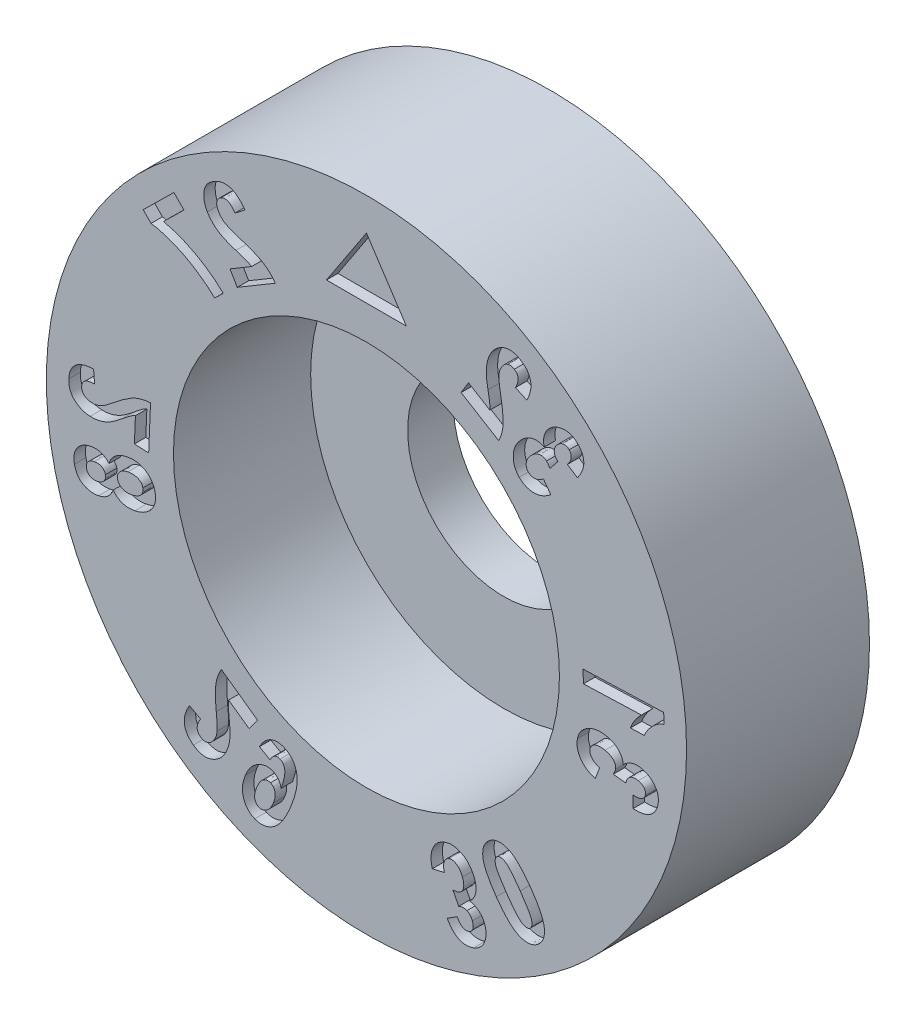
from build123d import *
from build123d.topology import SkipClean

# Parameters (mm, degrees)
SKETCH4_R           = 7
BOSS_EXTRUDE2_DEPTH = 4
SKETCH5_R           = 4.22
CUT_EXTRUDE2_DEPTH  = 3
SKETCH6_R           = 2.1
CUT_EXTRUDE3_DEPTH  = 11.344080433
CUT_EXTRUDE1_DEPTH  = 0.25
CUT_EXTRUDE4_DEPTH  = 0.25


with BuildPart() as part:
    # Sketch4 → Boss-Extrude2 (new body)
    with BuildSketch(Plane.XY):
        Circle(SKETCH4_R)
    extrude(amount=-BOSS_EXTRUDE2_DEPTH)

    # Sketch5 → Cut-Extrude2 (cut)
    with BuildSketch(Plane.XY):
        Circle(SKETCH5_R)
    extrude(amount=-CUT_EXTRUDE2_DEPTH, mode=Mode.SUBTRACT)

    # Sketch6 → Cut-Extrude3 (cut, through all)
    with BuildSketch(Plane.XY.offset(-3)):
        Circle(SKETCH6_R)
    extrude(amount=-CUT_EXTRUDE3_DEPTH, mode=Mode.SUBTRACT)

    # Sketch2 → Cut-Extrude1 (cut)
    # profile 1 of 12: a face of its own
    with BuildSketch(Plane.XY):
        with BuildLine():
            Line((-2.984728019, 4.112834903), (-2.824560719, 3.843310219))
            Line((-2.824560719, 3.843310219), (-1.990832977, 4.338826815))
            add(Edge.make_bspline(
                [(-1.990832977, 4.338826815), (-2.008826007, 4.362288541), (-2.044600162, 4.408935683), (-2.105880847, 4.472448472), (-2.17245835, 4.530291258), (-2.233360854, 4.573701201), (-2.287075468, 4.606151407), (-2.333329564, 4.630738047), (-2.38518643, 4.655627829), (-2.442680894, 4.680798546), (-2.505879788, 4.70602099), (-2.574436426, 4.732272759), (-2.648930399, 4.757960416), (-2.700509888, 4.774918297), (-2.727132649, 4.783671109)],
                knots=[0, 0, 0, 0, 1.212874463, 2.411464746, 3.615194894, 4.828993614, 5.4758883, 6.190167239, 6.978272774, 7.836544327, 8.765908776, 9.771237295, 10.84962379, 12, 12, 12, 12], degree=3))
            add(Edge.make_bspline(
                [(-2.727132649, 4.783671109), (-2.748099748, 4.790440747), (-2.788160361, 4.8033751), (-2.845067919, 4.822639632), (-2.896060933, 4.840666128), (-2.941115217, 4.857205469), (-2.980440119, 4.871733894), (-3.013405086, 4.885818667), (-3.040751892, 4.897978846), (-3.056757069, 4.906269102), (-3.063908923, 4.909973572)],
                knots=[0, 0, 0, 0, 1.468705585, 2.806170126, 4.004826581, 5.073890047, 6.005692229, 6.798695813, 7.463201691, 8, 8, 8, 8], degree=3))
            add(Edge.make_bspline(
                [(-3.063908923, 4.909973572), (-3.081156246, 4.920246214), (-3.114781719, 4.940273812), (-3.159172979, 4.976984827), (-3.197584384, 5.017228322), (-3.217487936, 5.047715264), (-3.227345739, 5.062814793)],
                knots=[0, 0, 0, 0, 1.063161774, 2.072745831, 3.045472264, 4, 4, 4, 4], degree=3))
            add(Edge.make_bspline(
                [(-3.227345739, 5.062814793), (-3.236052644, 5.078662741), (-3.252476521, 5.108556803), (-3.268662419, 5.154525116), (-3.275991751, 5.197973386), (-3.27317593, 5.238552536), (-3.26277803, 5.275521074), (-3.24439642, 5.308381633), (-3.218588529, 5.337042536), (-3.196818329, 5.351309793), (-3.185577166, 5.358676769)],
                knots=[0, 0, 0, 0, 1.283647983, 2.421351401, 3.447956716, 4.392970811, 5.28922529, 6.15596118, 7.047820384, 8, 8, 8, 8], degree=3))
            add(Edge.make_bspline(
                [(-3.185577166, 5.358676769), (-3.172646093, 5.365496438), (-3.147936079, 5.378528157), (-3.107410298, 5.387088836), (-3.067014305, 5.385712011), (-3.027039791, 5.37288572), (-2.987685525, 5.350122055), (-2.948779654, 5.317415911), (-2.910438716, 5.274513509), (-2.886978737, 5.241342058), (-2.874527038, 5.223735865)],
                knots=[0, 0, 0, 0, 0.919227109, 1.75655281, 2.582056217, 3.443836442, 4.378099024, 5.436281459, 6.639271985, 8, 8, 8, 8], degree=3))
            Line((-2.874527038, 5.223735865), (-2.655854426, 5.392984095))
            add(Edge.make_bspline(
                [(-2.655854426, 5.392984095), (-2.668942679, 5.410535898), (-2.694259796, 5.44448703), (-2.734998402, 5.490793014), (-2.775530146, 5.532212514), (-2.816716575, 5.568065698), (-2.858257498, 5.598591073), (-2.900192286, 5.623570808), (-2.942579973, 5.643121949), (-2.985423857, 5.657070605), (-3.028573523, 5.665925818), (-3.071852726, 5.669899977), (-3.115403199, 5.66962435), (-3.159042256, 5.664185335), (-3.203011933, 5.654141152), (-3.246938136, 5.639105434), (-3.291346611, 5.619893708), (-3.319893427, 5.603682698), (-3.33449238, 5.595392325)],
                knots=[0, 0, 0, 0, 1.323054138, 2.559234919, 3.725090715, 4.824117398, 5.856378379, 6.837364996, 7.769835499, 8.672279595, 9.555076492, 10.427018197, 11.295104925, 12.182674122, 13.07999712, 14.016741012, 14.985753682, 16, 16, 16, 16], degree=3))
            add(Edge.make_bspline(
                [(-3.33449238, 5.595392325), (-3.349957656, 5.585648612), (-3.380144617, 5.566629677), (-3.42127948, 5.534400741), (-3.456873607, 5.499668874), (-3.487352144, 5.462990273), (-3.511744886, 5.423692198), (-3.531558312, 5.382692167), (-3.545280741, 5.339099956), (-3.553578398, 5.293796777), (-3.557583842, 5.247975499), (-3.557963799, 5.202432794), (-3.554392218, 5.157495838), (-3.547123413, 5.113139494), (-3.53579622, 5.069604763), (-3.520736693, 5.026867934), (-3.502171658, 4.984669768), (-3.48692039, 4.957632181), (-3.479222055, 4.943984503)],
                knots=[0, 0, 0, 0, 1.168366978, 2.280557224, 3.334040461, 4.343530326, 5.321861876, 6.284637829, 7.248097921, 8.234333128, 9.224279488, 10.186043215, 11.143418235, 12.103393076, 13.05665975, 14.015947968, 14.99851632, 16, 16, 16, 16], degree=3))
            add(Edge.make_bspline(
                [(-3.479222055, 4.943984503), (-3.469756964, 4.92871213), (-3.451023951, 4.898485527), (-3.418875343, 4.855940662), (-3.384540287, 4.815732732), (-3.346865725, 4.778272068), (-3.306549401, 4.742771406), (-3.262393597, 4.709638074), (-3.215022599, 4.678123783), (-3.172513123, 4.653750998), (-3.135808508, 4.634704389), (-3.104746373, 4.620467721), (-3.070814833, 4.605483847), (-3.033597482, 4.590718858), (-2.99359019, 4.575241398), (-2.950317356, 4.559930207), (-2.903931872, 4.544422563), (-2.871859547, 4.534108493), (-2.855349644, 4.528799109)],
                knots=[0, 0, 0, 0, 1.121400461, 2.219440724, 3.325906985, 4.420433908, 5.534012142, 6.67760351, 7.864746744, 9.084686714, 9.735298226, 10.446257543, 11.217836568, 12.051231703, 12.946049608, 13.896326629, 14.917089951, 16, 16, 16, 16], degree=3))
            add(Edge.make_bspline(
                [(-2.855349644, 4.528799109), (-2.840108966, 4.523865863), (-2.810997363, 4.514442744), (-2.7694884, 4.501107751), (-2.732106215, 4.489231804), (-2.699451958, 4.477357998), (-2.670514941, 4.468156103), (-2.646190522, 4.459282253), (-2.626125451, 4.451524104), (-2.596401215, 4.440056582), (-2.558144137, 4.421903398), (-2.527003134, 4.402842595), (-2.51204712, 4.39368831)],
                knots=[0, 0, 0, 0, 1.298684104, 2.48064936, 3.534690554, 4.478127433, 5.296983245, 5.995946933, 6.576831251, 7.041046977, 8.578910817, 10, 10, 10, 10], degree=3))
            Line((-2.51204712, 4.39368831), (-2.984728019, 4.112834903))
        make_face()
    # profile 2 of 12: a face of its own
    with BuildSketch(Plane.XY):
        with BuildLine():
            Line((-3.990525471, 4.724313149), (-4.210008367, 4.946952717))
            Line((-4.210008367, 4.946952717), (-4.882255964, 4.28431128))
            Line((-4.882255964, 4.28431128), (-4.711001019, 4.110743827))
            add(Edge.make_bspline(
                [(-4.711001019, 4.110743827), (-4.695391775, 4.108827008), (-4.6632653, 4.104881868), (-4.613935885, 4.096667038), (-4.562057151, 4.085287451), (-4.507483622, 4.07158214), (-4.450065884, 4.055905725), (-4.390307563, 4.036940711), (-4.327772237, 4.015688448), (-4.240528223, 3.983989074), (-4.130167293, 3.939131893), (-3.999233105, 3.876834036), (-3.869942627, 3.806395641), (-3.743755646, 3.729158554), (-3.623609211, 3.647648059), (-3.512368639, 3.564099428), (-3.4113804, 3.479848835), (-3.350305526, 3.420501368), (-3.320676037, 3.391709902)],
                knots=[0, 0, 0, 0, 0.474858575, 0.977339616, 1.509398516, 2.078178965, 2.676377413, 3.306335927, 3.971003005, 4.670720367, 6.109130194, 7.566340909, 9.046823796, 10.553024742, 12.032178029, 13.429200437, 14.752818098, 16, 16, 16, 16], degree=3))
            Line((-3.320676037, 3.391709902), (-3.131235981, 3.578338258))
            add(Edge.make_bspline(
                [(-3.131235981, 3.578338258), (-3.153970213, 3.599681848), (-3.199489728, 3.642416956), (-3.27019192, 3.704007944), (-3.343715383, 3.762605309), (-3.419194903, 3.819251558), (-3.496810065, 3.873925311), (-3.576983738, 3.925872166), (-3.659391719, 3.975640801), (-3.743919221, 4.022513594), (-3.829593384, 4.06667635), (-3.915617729, 4.1080373), (-4.002161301, 4.145609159), (-4.088839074, 4.179899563), (-4.175514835, 4.21138332), (-4.262521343, 4.239026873), (-4.349822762, 4.26322755), (-4.408427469, 4.276828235), (-4.437608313, 4.283600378)],
                knots=[0, 0, 0, 0, 0.996155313, 1.994547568, 2.994521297, 3.999032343, 5.009080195, 6.026828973, 7.05031542, 8.084020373, 9.113948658, 10.129214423, 11.132785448, 12.12731008, 13.106737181, 14.078181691, 15.043075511, 16, 16, 16, 16], degree=3))
            Line((-4.437608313, 4.283600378), (-3.990525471, 4.724313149))
        make_face()
    # profile 3 of 12: a face of its own
    with BuildSketch(Plane.XY):
        with BuildLine():
            Line((-5.074667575, -0.248417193), (-4.761775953, -0.261415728))
            Line((-4.761775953, -0.261415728), (-4.721286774, 0.707070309))
            add(Edge.make_bspline(
                [(-4.721286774, 0.707070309), (-4.750700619, 0.704966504), (-4.809444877, 0.700764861), (-4.89608469, 0.683700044), (-4.981069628, 0.659673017), (-5.050646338, 0.632433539), (-5.106972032, 0.604973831), (-5.152731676, 0.5798159), (-5.201912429, 0.550191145), (-5.254262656, 0.515706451), (-5.310098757, 0.477002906), (-5.369056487, 0.433385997), (-5.431546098, 0.385426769), (-5.473932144, 0.351391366), (-5.495804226, 0.333828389)],
                knots=[0, 0, 0, 0, 1.210100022, 2.416767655, 3.618479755, 4.833802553, 5.479107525, 6.191017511, 6.977694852, 7.836418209, 8.765099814, 9.767552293, 10.848010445, 12, 12, 12, 12], degree=3))
            add(Edge.make_bspline(
                [(-5.495804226, 0.333828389), (-5.513029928, 0.320109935), (-5.545910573, 0.29392397), (-5.592715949, 0.256432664), (-5.635689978, 0.223798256), (-5.673991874, 0.194923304), (-5.708133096, 0.170491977), (-5.737698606, 0.150079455), (-5.762841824, 0.133817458), (-5.778629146, 0.125206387), (-5.785663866, 0.121369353)],
                knots=[0, 0, 0, 0, 1.469048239, 2.804138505, 4.000366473, 5.068631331, 6.003939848, 6.800677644, 7.465590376, 8, 8, 8, 8], degree=3))
            add(Edge.make_bspline(
                [(-5.785663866, 0.121369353), (-5.803636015, 0.112559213), (-5.838748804, 0.095346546), (-5.893858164, 0.078652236), (-5.948528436, 0.068080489), (-5.984973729, 0.068302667), (-6.003001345, 0.068412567)],
                knots=[0, 0, 0, 0, 1.060032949, 2.07102194, 3.045833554, 4, 4, 4, 4], degree=3))
            add(Edge.make_bspline(
                [(-6.003001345, 0.068412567), (-6.020987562, 0.069616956), (-6.05504094, 0.071897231), (-6.102164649, 0.083877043), (-6.142592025, 0.101341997), (-6.175159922, 0.125700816), (-6.199853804, 0.155217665), (-6.217595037, 0.188277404), (-6.227167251, 0.225572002), (-6.227561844, 0.251454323), (-6.227766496, 0.264877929)],
                knots=[0, 0, 0, 0, 1.280782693, 2.424910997, 3.442825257, 4.396654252, 5.290310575, 6.162051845, 7.046766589, 8, 8, 8, 8], degree=3))
            add(Edge.make_bspline(
                [(-6.227766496, 0.264877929), (-6.22639054, 0.279333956), (-6.223735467, 0.307228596), (-6.208620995, 0.345797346), (-6.185113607, 0.378592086), (-6.152929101, 0.405231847), (-6.112358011, 0.425702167), (-6.063601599, 0.439993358), (-6.00691352, 0.449460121), (-5.966312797, 0.450595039), (-5.944787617, 0.451196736)],
                knots=[0, 0, 0, 0, 0.914283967, 1.764220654, 2.582856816, 3.439909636, 4.378125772, 5.435421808, 6.640344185, 8, 8, 8, 8], degree=3))
            Line((-5.944787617, 0.451196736), (-5.966684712, 0.727168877))
            add(Edge.make_bspline(
                [(-5.966684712, 0.727168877), (-5.988475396, 0.725729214), (-6.030729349, 0.722937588), (-6.091867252, 0.714718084), (-6.148439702, 0.702805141), (-6.200954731, 0.688109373), (-6.249004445, 0.669882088), (-6.293087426, 0.648743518), (-6.332470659, 0.623825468), (-6.367677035, 0.595648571), (-6.398469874, 0.564192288), (-6.425963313, 0.53045707), (-6.449109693, 0.493586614), (-6.468590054, 0.454051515), (-6.484407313, 0.411844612), (-6.495927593, 0.366838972), (-6.504191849, 0.319247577), (-6.506147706, 0.286440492), (-6.507148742, 0.269649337)],
                knots=[0, 0, 0, 0, 1.320394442, 2.560354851, 3.726633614, 4.814132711, 5.854677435, 6.830653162, 7.765547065, 8.666756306, 9.55120701, 10.422789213, 11.293636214, 12.177623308, 13.084218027, 14.013917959, 14.983493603, 16, 16, 16, 16], degree=3))
            add(Edge.make_bspline(
                [(-6.507148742, 0.269649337), (-6.507551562, 0.251345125), (-6.508335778, 0.215710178), (-6.503251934, 0.163749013), (-6.494191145, 0.114931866), (-6.479763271, 0.069416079), (-6.460542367, 0.027283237), (-6.436481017, -0.011466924), (-6.407934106, -0.047089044), (-6.374688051, -0.07886096), (-6.338267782, -0.107046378), (-6.300133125, -0.132130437), (-6.260505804, -0.153760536), (-6.219580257, -0.172051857), (-6.176991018, -0.186394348), (-6.132980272, -0.197213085), (-6.087396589, -0.20498798), (-6.05637243, -0.20684554), (-6.040646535, -0.207787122)],
                knots=[0, 0, 0, 0, 1.169449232, 2.276703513, 3.330652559, 4.338217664, 5.320897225, 6.283413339, 7.246761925, 8.231187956, 9.215526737, 10.187219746, 11.146070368, 12.098479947, 13.049144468, 14.014511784, 14.993572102, 16, 16, 16, 16], degree=3))
            add(Edge.make_bspline(
                [(-6.040646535, -0.207787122), (-6.022713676, -0.208160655), (-5.987184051, -0.208900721), (-5.934099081, -0.205467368), (-5.8818015, -0.198181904), (-5.829930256, -0.18713595), (-5.778253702, -0.172701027), (-5.726433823, -0.154100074), (-5.674388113, -0.13152437), (-5.630771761, -0.109252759), (-5.594751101, -0.08898139), (-5.565753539, -0.070973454), (-5.534703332, -0.050811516), (-5.501764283, -0.028059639), (-5.467353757, -0.002323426), (-5.430526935, 0.025126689), (-5.391960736, 0.055365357), (-5.365798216, 0.076679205), (-5.352297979, 0.087677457)],
                knots=[0, 0, 0, 0, 1.120422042, 2.219845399, 3.319791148, 4.417222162, 5.531400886, 6.670011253, 7.854798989, 9.073997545, 9.728469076, 10.437086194, 11.206484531, 12.041787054, 12.938008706, 13.891350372, 14.911906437, 16, 16, 16, 16], degree=3))
            add(Edge.make_bspline(
                [(-5.352297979, 0.087677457), (-5.339899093, 0.097772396), (-5.316269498, 0.117011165), (-5.282667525, 0.144563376), (-5.25187841, 0.168674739), (-5.224520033, 0.189974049), (-5.200773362, 0.208831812), (-5.180195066, 0.224557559), (-5.162760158, 0.237245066), (-5.136630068, 0.255695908), (-5.100480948, 0.277669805), (-5.067466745, 0.29321593), (-5.051702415, 0.300639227)],
                knots=[0, 0, 0, 0, 1.297993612, 2.473694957, 3.527458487, 4.472565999, 5.288411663, 5.989114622, 6.574899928, 7.038751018, 8.585999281, 10, 10, 10, 10], degree=3))
            Line((-5.051702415, 0.300639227), (-5.074667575, -0.248417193))
        make_face()
    # profile 4 of 12: a face of its own
    with BuildSketch(Plane.XY):
        with BuildLine():
            add(Edge.make_bspline(
                [(-5.629555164, -0.89805691), (-5.641731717, -0.883946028), (-5.6655498, -0.856344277), (-5.707519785, -0.822178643), (-5.752636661, -0.794888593), (-5.801232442, -0.774826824), (-5.853097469, -0.76197605), (-5.90829704, -0.756562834), (-5.966814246, -0.758827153), (-6.006337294, -0.765410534), (-6.026741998, -0.768809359)],
                knots=[0, 0, 0, 0, 1.011792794, 1.979128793, 2.927893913, 3.869977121, 4.826395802, 5.822904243, 6.876023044, 8, 8, 8, 8], degree=3))
            add(Edge.make_bspline(
                [(-6.026741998, -0.768809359), (-6.0432599, -0.772481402), (-6.075438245, -0.779634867), (-6.121362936, -0.794920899), (-6.164193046, -0.812616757), (-6.203577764, -0.83394044), (-6.239915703, -0.857871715), (-6.272711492, -0.8852641), (-6.301968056, -0.915858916), (-6.328153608, -0.949100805), (-6.350203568, -0.984873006), (-6.368424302, -1.022441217), (-6.382042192, -1.061939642), (-6.391129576, -1.103262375), (-6.396399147, -1.146200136), (-6.397271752, -1.190847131), (-6.394112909, -1.23730702), (-6.388399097, -1.268499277), (-6.38547949, -1.284437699)],
                knots=[0, 0, 0, 0, 1.144200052, 2.229003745, 3.27017894, 4.275911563, 5.2544904, 6.209583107, 7.160266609, 8.113981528, 9.067360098, 9.997857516, 10.933682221, 11.887060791, 12.855624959, 13.855857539, 14.904399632, 16, 16, 16, 16], degree=3))
            add(Edge.make_bspline(
                [(-6.38547949, -1.284437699), (-6.381773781, -1.301192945), (-6.37458087, -1.333715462), (-6.358398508, -1.379582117), (-6.33989198, -1.422024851), (-6.317048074, -1.460153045), (-6.291571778, -1.495006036), (-6.261887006, -1.525126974), (-6.229420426, -1.552059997), (-6.193347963, -1.574383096), (-6.155110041, -1.592652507), (-6.115869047, -1.608228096), (-6.075216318, -1.619037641), (-6.033711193, -1.626916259), (-5.991093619, -1.630631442), (-5.947556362, -1.630250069), (-5.902840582, -1.626815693), (-5.872991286, -1.621526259), (-5.857745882, -1.618824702)],
                knots=[0, 0, 0, 0, 1.16791611, 2.26696598, 3.307453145, 4.316693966, 5.288685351, 6.24104535, 7.189711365, 8.156168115, 9.121817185, 10.074177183, 11.027526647, 11.982511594, 12.94920379, 13.936066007, 14.945854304, 16, 16, 16, 16], degree=3))
            add(Edge.make_bspline(
                [(-5.857745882, -1.618824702), (-5.837514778, -1.614266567), (-5.798081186, -1.605382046), (-5.743185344, -1.583402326), (-5.693275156, -1.556742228), (-5.64983327, -1.523480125), (-5.611909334, -1.486087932), (-5.580159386, -1.444785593), (-5.554894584, -1.399742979), (-5.543693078, -1.367382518), (-5.538069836, -1.351137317)],
                knots=[0, 0, 0, 0, 1.132869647, 2.208140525, 3.22364227, 4.219399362, 5.189819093, 6.129570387, 7.061029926, 8, 8, 8, 8], degree=3))
            add(Edge.make_bspline(
                [(-5.538069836, -1.351137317), (-5.523952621, -1.368309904), (-5.496368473, -1.401864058), (-5.447510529, -1.443605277), (-5.394260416, -1.476345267), (-5.33656132, -1.500556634), (-5.274057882, -1.515204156), (-5.20730214, -1.521618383), (-5.135984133, -1.518725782), (-5.087730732, -1.510387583), (-5.062675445, -1.506058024)],
                knots=[0, 0, 0, 0, 1.004499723, 1.962729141, 2.891797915, 3.82361136, 4.781421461, 5.785649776, 6.850212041, 8, 8, 8, 8], degree=3))
            add(Edge.make_bspline(
                [(-5.062675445, -1.506058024), (-5.036843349, -1.500193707), (-4.986492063, -1.488763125), (-4.915366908, -1.462600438), (-4.850493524, -1.429994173), (-4.792113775, -1.39144364), (-4.741090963, -1.347205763), (-4.697778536, -1.298663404), (-4.663117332, -1.245500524), (-4.637301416, -1.188429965), (-4.619497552, -1.128698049), (-4.610992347, -1.066713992), (-4.610539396, -1.003133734), (-4.617699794, -0.960927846), (-4.621331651, -0.939520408)],
                knots=[0, 0, 0, 0, 1.182368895, 2.304644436, 3.37535713, 4.419695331, 5.421339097, 6.383920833, 7.316702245, 8.244750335, 9.173024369, 10.090771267, 11.031611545, 12, 12, 12, 12], degree=3))
            add(Edge.make_bspline(
                [(-4.621331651, -0.939520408), (-4.62515429, -0.922938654), (-4.632682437, -0.89028324), (-4.648773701, -0.843478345), (-4.669489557, -0.800039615), (-4.69387138, -0.759601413), (-4.721781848, -0.721797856), (-4.754669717, -0.687959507), (-4.790848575, -0.656679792), (-4.830995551, -0.629133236), (-4.874034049, -0.605076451), (-4.919941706, -0.586310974), (-4.967850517, -0.571874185), (-5.018056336, -0.562352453), (-5.070480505, -0.557987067), (-5.125173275, -0.558107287), (-5.181992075, -0.563115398), (-5.220244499, -0.57001993), (-5.239775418, -0.573545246)],
                knots=[0, 0, 0, 0, 1.010618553, 1.990269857, 2.933652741, 3.864632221, 4.792578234, 5.718656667, 6.662249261, 7.629962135, 8.606452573, 9.586179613, 10.570440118, 11.575020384, 12.61635033, 13.6913375, 14.821243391, 16, 16, 16, 16], degree=3))
            add(Edge.make_bspline(
                [(-5.239775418, -0.573545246), (-5.264659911, -0.5792229), (-5.312895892, -0.590228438), (-5.380534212, -0.616238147), (-5.441558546, -0.647991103), (-5.495214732, -0.686777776), (-5.541144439, -0.731721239), (-5.579453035, -0.781903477), (-5.610012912, -0.837488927), (-5.622983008, -0.877687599), (-5.629555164, -0.89805691)],
                knots=[0, 0, 0, 0, 1.143151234, 2.215878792, 3.238875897, 4.219859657, 5.17289422, 6.109652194, 7.04213051, 8, 8, 8, 8], degree=3))
        make_face()
        with BuildLine():
            add(Edge.make_bspline(
                [(-5.951634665, -1.020755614), (-5.935567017, -1.017922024), (-5.905216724, -1.012569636), (-5.861028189, -1.013352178), (-5.821216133, -1.020218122), (-5.786795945, -1.035793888), (-5.757314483, -1.056075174), (-5.734253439, -1.082178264), (-5.716817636, -1.112505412), (-5.710962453, -1.135188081), (-5.707977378, -1.146752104)],
                knots=[0, 0, 0, 0, 1.266481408, 2.392265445, 3.421561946, 4.385640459, 5.308093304, 6.184680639, 7.074518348, 8, 8, 8, 8], degree=3))
            add(Edge.make_bspline(
                [(-5.707977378, -1.146752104), (-5.70624044, -1.158791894), (-5.702880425, -1.18208223), (-5.706479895, -1.217272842), (-5.718321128, -1.250128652), (-5.736819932, -1.281167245), (-5.763278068, -1.308247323), (-5.796546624, -1.331373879), (-5.83746354, -1.348321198), (-5.867402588, -1.355628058), (-5.883188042, -1.359480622)],
                knots=[0, 0, 0, 0, 0.939445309, 1.817307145, 2.706438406, 3.624991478, 4.593891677, 5.615019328, 6.742511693, 8, 8, 8, 8], degree=3))
            add(Edge.make_bspline(
                [(-5.883188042, -1.359480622), (-5.898714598, -1.362019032), (-5.928176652, -1.366835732), (-5.971243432, -1.366223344), (-6.010342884, -1.358752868), (-6.044509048, -1.343541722), (-6.073608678, -1.323190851), (-6.096480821, -1.297639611), (-6.113763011, -1.267744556), (-6.119485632, -1.245391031), (-6.122418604, -1.233934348)],
                knots=[0, 0, 0, 0, 1.243393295, 2.359371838, 3.391139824, 4.372088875, 5.297779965, 6.180852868, 7.067646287, 8, 8, 8, 8], degree=3))
            add(Edge.make_bspline(
                [(-6.122418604, -1.233934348), (-6.124224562, -1.221781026), (-6.127741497, -1.198113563), (-6.123887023, -1.162605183), (-6.112837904, -1.129069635), (-6.093742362, -1.098202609), (-6.067528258, -1.071150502), (-6.034897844, -1.04835144), (-5.995526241, -1.031436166), (-5.966729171, -1.024428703), (-5.951634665, -1.020755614)],
                knots=[0, 0, 0, 0, 0.95691839, 1.863509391, 2.761565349, 3.696043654, 4.673838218, 5.686244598, 6.787203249, 8, 8, 8, 8], degree=3))
        make_face(mode=Mode.SUBTRACT)
        with BuildLine():
            add(Edge.make_bspline(
                [(-5.217648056, -0.846995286), (-5.206402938, -0.844937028), (-5.184469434, -0.840922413), (-5.15215859, -0.83750895), (-5.121507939, -0.83549885), (-5.092446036, -0.836604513), (-5.064939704, -0.839507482), (-5.038991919, -0.844956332), (-5.014574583, -0.852317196), (-4.985105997, -0.865114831), (-4.953063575, -0.885120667), (-4.921109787, -0.914061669), (-4.898977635, -0.949333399), (-4.891743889, -0.975413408), (-4.888112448, -0.988505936)],
                knots=[0, 0, 0, 0, 1.030154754, 2.009307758, 2.927363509, 3.796357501, 4.627580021, 5.417863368, 6.182963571, 6.922562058, 8.308156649, 9.569291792, 10.779750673, 12, 12, 12, 12], degree=3))
            add(Edge.make_bspline(
                [(-4.888112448, -0.988505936), (-4.88619555, -1.001996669), (-4.882420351, -1.028565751), (-4.889633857, -1.068792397), (-4.905904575, -1.107067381), (-4.927213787, -1.136487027), (-4.948511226, -1.158557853), (-4.967622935, -1.174273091), (-4.98923517, -1.188816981), (-5.013740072, -1.201466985), (-5.040397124, -1.213659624), (-5.06992396, -1.224006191), (-5.102087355, -1.232726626), (-5.124419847, -1.237679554), (-5.135915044, -1.240228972)],
                knots=[0, 0, 0, 0, 1.234462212, 2.431189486, 3.666499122, 4.998110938, 5.713135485, 6.456777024, 7.247699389, 8.08142026, 8.965895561, 9.916336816, 10.927476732, 12, 12, 12, 12], degree=3))
            add(Edge.make_bspline(
                [(-5.135915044, -1.240228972), (-5.155611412, -1.243647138), (-5.19310423, -1.250153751), (-5.248077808, -1.249624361), (-5.298168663, -1.241589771), (-5.342650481, -1.224608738), (-5.380148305, -1.200769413), (-5.41033841, -1.171435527), (-5.432150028, -1.136392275), (-5.439180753, -1.11012646), (-5.442729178, -1.096870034)],
                knots=[0, 0, 0, 0, 1.26791763, 2.41353154, 3.475530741, 4.475612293, 5.4165296, 6.279746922, 7.131783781, 8, 8, 8, 8], degree=3))
            add(Edge.make_bspline(
                [(-5.442729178, -1.096870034), (-5.444620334, -1.083383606), (-5.448358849, -1.056723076), (-5.441427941, -1.016164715), (-5.424768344, -0.97750326), (-5.39904031, -0.941078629), (-5.364928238, -0.908040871), (-5.322342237, -0.881395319), (-5.272771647, -0.860125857), (-5.236617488, -0.85151385), (-5.217648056, -0.846995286)],
                knots=[0, 0, 0, 0, 0.86876114, 1.717403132, 2.597491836, 3.549105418, 4.558140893, 5.621095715, 6.751832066, 8, 8, 8, 8], degree=3))
        make_face(mode=Mode.SUBTRACT)
    # profile 5 of 12: a face of its own
    with BuildSketch(Plane.XY):
        with BuildLine():
            Line((-2.565622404, -4.385757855), (-2.383369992, -4.130588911))
            Line((-2.383369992, -4.130588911), (-3.173150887, -3.566607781))
            add(Edge.make_bspline(
                [(-3.173150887, -3.566607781), (-3.187612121, -3.59233073), (-3.216434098, -3.643597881), (-3.249239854, -3.725537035), (-3.275948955, -3.809748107), (-3.290645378, -3.883124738), (-3.299081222, -3.945466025), (-3.302539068, -3.997750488), (-3.304815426, -4.055246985), (-3.304651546, -4.117954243), (-3.302315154, -4.185932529), (-3.298208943, -4.259244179), (-3.292451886, -4.337919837), (-3.287008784, -4.392056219), (-3.284196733, -4.420024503)],
                knots=[0, 0, 0, 0, 1.209363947, 2.410324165, 3.612765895, 4.829526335, 5.474513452, 6.192476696, 6.977960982, 7.83484588, 8.764167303, 9.768041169, 10.846911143, 12, 12, 12, 12], degree=3))
            add(Edge.make_bspline(
                [(-3.284196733, -4.420024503), (-3.282036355, -4.441939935), (-3.277901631, -4.483883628), (-3.272771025, -4.543785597), (-3.268698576, -4.597665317), (-3.265272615, -4.645536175), (-3.263648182, -4.687474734), (-3.263133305, -4.723519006), (-3.262886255, -4.75347648), (-3.264341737, -4.771416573), (-3.264985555, -4.779352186)],
                knots=[0, 0, 0, 0, 1.467247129, 2.808147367, 4.005621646, 5.067418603, 6.00565306, 6.801285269, 7.469760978, 8, 8, 8, 8], degree=3))
            add(Edge.make_bspline(
                [(-3.264985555, -4.779352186), (-3.267518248, -4.79922288), (-3.272456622, -4.837967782), (-3.287500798, -4.893615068), (-3.309434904, -4.944825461), (-3.329359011, -4.97538102), (-3.339199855, -4.990472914)],
                knots=[0, 0, 0, 0, 1.061048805, 2.068887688, 3.04619181, 4, 4, 4, 4], degree=3))
            add(Edge.make_bspline(
                [(-3.339199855, -4.990472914), (-3.350138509, -5.004838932), (-3.370818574, -5.031998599), (-3.406484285, -5.065198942), (-3.443205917, -5.089354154), (-3.481173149, -5.103773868), (-3.519351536, -5.108311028), (-3.556793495, -5.104474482), (-3.593679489, -5.092753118), (-3.615570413, -5.078493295), (-3.62686709, -5.071134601)],
                knots=[0, 0, 0, 0, 1.281297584, 2.422356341, 3.444481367, 4.386937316, 5.28112054, 6.150630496, 7.045644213, 8, 8, 8, 8], degree=3))
            add(Edge.make_bspline(
                [(-3.62686709, -5.071134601), (-3.638280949, -5.062118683), (-3.660207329, -5.044798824), (-3.683892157, -5.010865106), (-3.698907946, -4.973462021), (-3.703418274, -4.93174513), (-3.698035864, -4.886768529), (-3.683681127, -4.838192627), (-3.660240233, -4.785872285), (-3.639229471, -4.751130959), (-3.628065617, -4.73267151)],
                knots=[0, 0, 0, 0, 0.915953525, 1.759575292, 2.584267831, 3.442131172, 4.383692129, 5.432886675, 6.635990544, 8, 8, 8, 8], degree=3))
            Line((-3.628065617, -4.73267151), (-3.871518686, -4.60007985))
            add(Edge.make_bspline(
                [(-3.871518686, -4.60007985), (-3.882214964, -4.619157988), (-3.902903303, -4.656058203), (-3.928997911, -4.711914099), (-3.950653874, -4.765618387), (-3.966900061, -4.81777292), (-3.977409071, -4.868170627), (-3.983893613, -4.916567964), (-3.984538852, -4.963301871), (-3.980125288, -5.008137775), (-3.971185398, -5.051270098), (-3.957303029, -5.092590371), (-3.939333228, -5.132258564), (-3.91670606, -5.170116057), (-3.890231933, -5.206484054), (-3.858568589, -5.240554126), (-3.823031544, -5.273315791), (-3.796714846, -5.293079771), (-3.783239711, -5.303199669)],
                knots=[0, 0, 0, 0, 1.321455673, 2.555909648, 3.722935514, 4.819044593, 5.852080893, 6.8311177, 7.765651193, 8.669704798, 9.549050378, 10.421853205, 11.298838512, 12.175736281, 13.083039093, 14.012080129, 14.982110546, 16, 16, 16, 16], degree=3))
            add(Edge.make_bspline(
                [(-3.783239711, -5.303199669), (-3.768124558, -5.313546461), (-3.73862603, -5.333739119), (-3.692280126, -5.357930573), (-3.646324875, -5.376872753), (-3.600355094, -5.389550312), (-3.554618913, -5.396544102), (-3.508922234, -5.398203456), (-3.463416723, -5.393507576), (-3.418639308, -5.38283015), (-3.375215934, -5.367723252), (-3.333213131, -5.349860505), (-3.293565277, -5.328240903), (-3.255874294, -5.303848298), (-3.220690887, -5.275872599), (-3.187451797, -5.244887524), (-3.156308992, -5.210670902), (-3.137605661, -5.185752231), (-3.128161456, -5.173169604)],
                knots=[0, 0, 0, 0, 1.169083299, 2.281567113, 3.332103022, 4.338705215, 5.319419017, 6.281329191, 7.251523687, 8.231800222, 9.214697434, 10.185422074, 11.143759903, 12.095483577, 13.04960681, 14.010744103, 14.995529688, 16, 16, 16, 16], degree=3))
            add(Edge.make_bspline(
                [(-3.128161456, -5.173169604), (-3.117994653, -5.158427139), (-3.097827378, -5.129183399), (-3.072030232, -5.082712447), (-3.04911084, -5.035189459), (-3.029653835, -4.98582151), (-3.013847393, -4.93436982), (-3.000919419, -4.880779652), (-2.991515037, -4.824709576), (-2.98638844, -4.776000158), (-2.983557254, -4.734635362), (-2.983098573, -4.700385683), (-2.982770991, -4.663276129), (-2.984441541, -4.623121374), (-2.986196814, -4.580062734), (-2.989659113, -4.53412495), (-2.993903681, -4.485297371), (-2.997461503, -4.451777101), (-2.999295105, -4.434501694)],
                knots=[0, 0, 0, 0, 1.117086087, 2.215896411, 3.312966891, 4.408369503, 5.524013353, 6.669705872, 7.846558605, 9.06944417, 9.725247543, 10.433429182, 11.206744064, 12.041033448, 12.941153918, 13.896258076, 14.915790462, 16, 16, 16, 16], degree=3))
            add(Edge.make_bspline(
                [(-2.999295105, -4.434501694), (-3.001015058, -4.418570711), (-3.004288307, -4.388252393), (-3.008528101, -4.344930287), (-3.01212514, -4.305991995), (-3.014916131, -4.271335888), (-3.017290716, -4.241027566), (-3.019741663, -4.215176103), (-3.020475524, -4.193665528), (-3.021726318, -4.161785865), (-3.020835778, -4.119450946), (-3.015812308, -4.08324232), (-3.013410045, -4.065927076)],
                knots=[0, 0, 0, 0, 1.299416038, 2.472924, 3.529933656, 4.470514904, 5.292360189, 5.995469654, 6.575649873, 7.037213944, 8.583172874, 10, 10, 10, 10], degree=3))
            Line((-3.013410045, -4.065927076), (-2.565622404, -4.385757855))
        make_face()
    # profile 6 of 12: a face of its own
    with BuildSketch(Plane.XY):
        with BuildLine():
            Line((-2.34077844, -4.612870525), (-2.107204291, -4.744860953))
            add(Edge.make_bspline(
                [(-2.107204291, -4.744860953), (-2.099778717, -4.731442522), (-2.085761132, -4.706111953), (-2.061918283, -4.672539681), (-2.036217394, -4.64641986), (-2.009647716, -4.62646893), (-1.981141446, -4.614493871), (-1.951538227, -4.609005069), (-1.920727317, -4.611870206), (-1.900929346, -4.618434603), (-1.890659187, -4.621839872)],
                knots=[0, 0, 0, 0, 1.326234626, 2.503591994, 3.548215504, 4.4860609, 5.357316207, 6.19900804, 7.065738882, 8, 8, 8, 8], degree=3))
            add(Edge.make_bspline(
                [(-1.890659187, -4.621839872), (-1.883873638, -4.624929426), (-1.870405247, -4.63106177), (-1.851853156, -4.643118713), (-1.835701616, -4.658117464), (-1.821591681, -4.675399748), (-1.809863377, -4.695161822), (-1.799724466, -4.717042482), (-1.792324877, -4.741645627), (-1.786278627, -4.768987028), (-1.783622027, -4.800451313), (-1.784302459, -4.836647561), (-1.789118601, -4.878019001), (-1.797096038, -4.924639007), (-1.808357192, -4.976649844), (-1.823184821, -5.034046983), (-1.842151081, -5.096537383), (-1.856230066, -5.139834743), (-1.863580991, -5.162441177)],
                knots=[0, 0, 0, 0, 0.603436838, 1.197740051, 1.782688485, 2.382074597, 2.998473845, 3.639439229, 4.330442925, 5.075106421, 5.904013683, 6.881146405, 8.002986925, 9.274115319, 10.711296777, 12.312153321, 14.074500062, 16, 16, 16, 16], degree=3))
            add(Edge.make_bspline(
                [(-1.863580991, -5.162441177), (-1.867409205, -5.148584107), (-1.874861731, -5.121608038), (-1.889421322, -5.083222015), (-1.908339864, -5.048855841), (-1.929601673, -5.017410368), (-1.954704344, -4.98969128), (-1.983136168, -4.96572376), (-2.014886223, -4.945304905), (-2.038047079, -4.935145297), (-2.049819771, -4.929981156)],
                knots=[0, 0, 0, 0, 1.111532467, 2.163861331, 3.165401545, 4.138427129, 5.093198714, 6.046740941, 7.007156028, 8, 8, 8, 8], degree=3))
            add(Edge.make_bspline(
                [(-2.049819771, -4.929981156), (-2.062562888, -4.925477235), (-2.087859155, -4.916536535), (-2.127278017, -4.908861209), (-2.167329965, -4.906170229), (-2.208129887, -4.908156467), (-2.249697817, -4.915829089), (-2.29191271, -4.92824986), (-2.334532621, -4.946151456), (-2.377694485, -4.967830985), (-2.420108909, -4.994386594), (-2.460107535, -5.026026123), (-2.498001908, -5.061665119), (-2.533180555, -5.102034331), (-2.565796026, -5.147002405), (-2.596232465, -5.196195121), (-2.624105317, -5.24981009), (-2.63990892, -5.287794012), (-2.647996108, -5.307231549)],
                knots=[0, 0, 0, 0, 0.826942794, 1.641557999, 2.450085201, 3.280832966, 4.136361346, 5.032929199, 5.970758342, 6.963688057, 7.988836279, 9.029530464, 10.082376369, 11.170743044, 12.303806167, 13.481119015, 14.711011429, 16, 16, 16, 16], degree=3))
            add(Edge.make_bspline(
                [(-2.647996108, -5.307231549), (-2.655887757, -5.328280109), (-2.671288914, -5.369357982), (-2.689742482, -5.430883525), (-2.702328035, -5.490735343), (-2.709500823, -5.548653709), (-2.712581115, -5.604696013), (-2.708994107, -5.658841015), (-2.701565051, -5.711285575), (-2.687559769, -5.761166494), (-2.670097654, -5.808240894), (-2.648299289, -5.851602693), (-2.623220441, -5.89132945), (-2.594265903, -5.927117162), (-2.561744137, -5.959207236), (-2.525118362, -5.986647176), (-2.485233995, -6.01101841), (-2.456447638, -6.023588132), (-2.441784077, -6.029991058)],
                knots=[0, 0, 0, 0, 1.282334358, 2.50257345, 3.660893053, 4.767188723, 5.83010633, 6.857389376, 7.858429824, 8.846422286, 9.806957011, 10.719195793, 11.610264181, 12.48231837, 13.340134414, 14.209753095, 15.088061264, 16, 16, 16, 16], degree=3))
            add(Edge.make_bspline(
                [(-2.441784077, -6.029991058), (-2.425023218, -6.036028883), (-2.392021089, -6.04791736), (-2.340739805, -6.057708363), (-2.289400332, -6.061136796), (-2.237997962, -6.057002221), (-2.186411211, -6.046596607), (-2.13481127, -6.028712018), (-2.082957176, -6.004452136), (-2.031039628, -5.973069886), (-1.979241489, -5.933835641), (-1.929131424, -5.884311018), (-1.879813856, -5.825816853), (-1.831471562, -5.757956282), (-1.784500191, -5.680521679), (-1.738216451, -5.593788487), (-1.692709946, -5.497778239), (-1.664723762, -5.42987845), (-1.65021925, -5.394687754)],
                knots=[0, 0, 0, 0, 0.75345351, 1.483549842, 2.202390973, 2.926352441, 3.66061858, 4.425228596, 5.23322058, 6.080870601, 6.989858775, 7.978191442, 9.057617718, 10.226628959, 11.502774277, 12.890311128, 14.388329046, 16, 16, 16, 16], degree=3))
            add(Edge.make_bspline(
                [(-1.65021925, -5.394687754), (-1.636168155, -5.358534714), (-1.60901407, -5.288668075), (-1.575549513, -5.185664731), (-1.548631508, -5.089039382), (-1.529874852, -4.998391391), (-1.517816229, -4.913947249), (-1.513646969, -4.835401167), (-1.516623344, -4.763045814), (-1.527536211, -4.696713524), (-1.544638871, -4.636233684), (-1.566457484, -4.580706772), (-1.594005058, -4.530603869), (-1.625736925, -4.485165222), (-1.663232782, -4.445520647), (-1.705168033, -4.410475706), (-1.752460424, -4.380792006), (-1.786918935, -4.365728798), (-1.804428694, -4.358074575)],
                knots=[0, 0, 0, 0, 1.586086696, 3.065151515, 4.427548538, 5.686374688, 6.848534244, 7.912933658, 8.899058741, 9.804391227, 10.65542453, 11.465583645, 12.238750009, 12.98882053, 13.725984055, 14.46344957, 15.219216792, 16, 16, 16, 16], degree=3))
            add(Edge.make_bspline(
                [(-1.804428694, -4.358074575), (-1.81686811, -4.353514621), (-1.841250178, -4.344576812), (-1.878443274, -4.334792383), (-1.915327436, -4.329394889), (-1.951877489, -4.327086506), (-1.987973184, -4.329103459), (-2.023620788, -4.334997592), (-2.058920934, -4.344041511), (-2.093614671, -4.357601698), (-2.127944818, -4.374305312), (-2.161011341, -4.396101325), (-2.19364985, -4.421430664), (-2.224756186, -4.451744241), (-2.255692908, -4.485569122), (-2.284887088, -4.524185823), (-2.314124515, -4.566524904), (-2.331697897, -4.597081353), (-2.34077844, -4.612870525)],
                knots=[0, 0, 0, 0, 0.965676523, 1.892788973, 2.797785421, 3.679605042, 4.558717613, 5.426960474, 6.310678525, 7.210102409, 8.138419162, 9.088740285, 10.092018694, 11.146196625, 12.251187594, 13.431120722, 14.672605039, 16, 16, 16, 16], degree=3))
        make_face()
        with BuildLine():
            add(Edge.make_bspline(
                [(-2.034105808, -5.525390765), (-2.039246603, -5.537736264), (-2.049196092, -5.561629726), (-2.066068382, -5.595379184), (-2.083559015, -5.626315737), (-2.101818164, -5.654562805), (-2.121253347, -5.679844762), (-2.141810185, -5.701939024), (-2.16295084, -5.721430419), (-2.185194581, -5.737486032), (-2.207537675, -5.750769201), (-2.229403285, -5.761536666), (-2.250637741, -5.769482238), (-2.271390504, -5.774753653), (-2.291769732, -5.77695543), (-2.311655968, -5.776960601), (-2.330950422, -5.773576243), (-2.343128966, -5.769408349), (-2.349245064, -5.767315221)],
                knots=[0, 0, 0, 0, 1.466787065, 2.838817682, 4.136495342, 5.364253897, 6.525948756, 7.629879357, 8.671718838, 9.675300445, 10.633226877, 11.520881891, 12.345602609, 13.116525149, 13.863108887, 14.589077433, 15.291430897, 16, 16, 16, 16], degree=3))
            add(Edge.make_bspline(
                [(-2.349245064, -5.767315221), (-2.360391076, -5.761872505), (-2.382331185, -5.751158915), (-2.409423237, -5.725118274), (-2.429177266, -5.691666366), (-2.440030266, -5.658910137), (-2.445136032, -5.629303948), (-2.446244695, -5.604104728), (-2.444090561, -5.576784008), (-2.440164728, -5.547289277), (-2.433572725, -5.515574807), (-2.424449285, -5.481653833), (-2.412077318, -5.4457097), (-2.402743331, -5.421134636), (-2.397903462, -5.408391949)],
                knots=[0, 0, 0, 0, 1.10011737, 2.16550054, 3.291410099, 4.532399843, 5.218042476, 5.964072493, 6.773069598, 7.657182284, 8.614295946, 9.657356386, 10.785290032, 12, 12, 12, 12], degree=3))
            add(Edge.make_bspline(
                [(-2.397903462, -5.408391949), (-2.392661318, -5.395804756), (-2.382496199, -5.371396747), (-2.36578586, -5.336889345), (-2.348931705, -5.305437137), (-2.33132402, -5.277343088), (-2.312838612, -5.252794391), (-2.294181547, -5.231191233), (-2.274595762, -5.213182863), (-2.248761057, -5.193908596), (-2.215878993, -5.176401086), (-2.1756866, -5.164840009), (-2.135436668, -5.163659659), (-2.110599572, -5.171809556), (-2.098088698, -5.1759148)],
                knots=[0, 0, 0, 0, 1.162407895, 2.25404202, 3.267624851, 4.203885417, 5.077733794, 5.885743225, 6.634329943, 7.341201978, 8.630662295, 9.785200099, 10.884366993, 12, 12, 12, 12], degree=3))
            add(Edge.make_bspline(
                [(-2.098088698, -5.1759148), (-2.086640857, -5.181379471), (-2.063903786, -5.192233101), (-2.036450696, -5.219791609), (-2.015091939, -5.254349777), (-2.003420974, -5.288487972), (-1.99670856, -5.318823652), (-1.994914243, -5.343905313), (-1.994673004, -5.370501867), (-1.998241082, -5.398467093), (-2.002858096, -5.428195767), (-2.011362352, -5.459151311), (-2.020935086, -5.492093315), (-2.029614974, -5.514037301), (-2.034105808, -5.525390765)],
                knots=[0, 0, 0, 0, 1.148529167, 2.281145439, 3.484583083, 4.825606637, 5.546679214, 6.31075974, 7.111930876, 7.966232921, 8.875681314, 9.851054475, 10.888170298, 12, 12, 12, 12], degree=3))
        make_face(mode=Mode.SUBTRACT)
    # profile 7 of 12: a face of its own
    with BuildSketch(Plane.XY):
        with BuildLine():
            Line((1.440639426, -5.03463351), (1.704726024, -4.974519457))
            add(Edge.make_bspline(
                [(1.704726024, -4.974519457), (1.699671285, -4.955323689), (1.690088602, -4.918932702), (1.684921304, -4.865319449), (1.686950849, -4.816266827), (1.698016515, -4.772352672), (1.715697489, -4.734239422), (1.738414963, -4.701925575), (1.767735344, -4.676971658), (1.790464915, -4.666274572), (1.801905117, -4.660890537)],
                knots=[0, 0, 0, 0, 1.315866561, 2.494595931, 3.56151785, 4.559725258, 5.479134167, 6.337549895, 7.163258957, 8, 8, 8, 8], degree=3))
            add(Edge.make_bspline(
                [(1.801905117, -4.660890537), (1.815162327, -4.656760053), (1.841280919, -4.64862241), (1.883365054, -4.648745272), (1.925201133, -4.659788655), (1.959314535, -4.676718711), (1.985502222, -4.695313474), (2.005004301, -4.711765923), (2.023220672, -4.730730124), (2.040365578, -4.752238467), (2.056364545, -4.776170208), (2.071671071, -4.802394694), (2.085773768, -4.830991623), (2.093916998, -4.851216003), (2.09809957, -4.861603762)],
                knots=[0, 0, 0, 0, 1.248806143, 2.460326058, 3.741771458, 5.130071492, 5.874819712, 6.640245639, 7.431969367, 8.246551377, 9.122306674, 10.030631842, 10.988482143, 12, 12, 12, 12], degree=3))
            add(Edge.make_bspline(
                [(2.09809957, -4.861603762), (2.104936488, -4.880739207), (2.117959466, -4.917188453), (2.127650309, -4.971994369), (2.129141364, -5.023098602), (2.120363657, -5.069721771), (2.104447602, -5.110611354), (2.082118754, -5.145009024), (2.052800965, -5.171695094), (2.029437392, -5.182739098), (2.017681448, -5.188296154)],
                knots=[0, 0, 0, 0, 1.300833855, 2.477831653, 3.553091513, 4.56099316, 5.497838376, 6.350105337, 7.169815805, 8, 8, 8, 8], degree=3))
            add(Edge.make_bspline(
                [(2.017681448, -5.188296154), (2.008887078, -5.191233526), (1.990381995, -5.197414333), (1.960242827, -5.204080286), (1.926529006, -5.208097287), (1.902886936, -5.209528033), (1.89052256, -5.210276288)],
                knots=[0, 0, 0, 0, 0.858431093, 1.806307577, 2.852738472, 4, 4, 4, 4], degree=3))
            Line((1.89052256, -5.210276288), (2.018565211, -5.456026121))
            add(Edge.make_bspline(
                [(2.018565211, -5.456026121), (2.034470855, -5.450182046), (2.064962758, -5.438978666), (2.11168364, -5.432526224), (2.156524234, -5.434443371), (2.183939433, -5.443940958), (2.197604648, -5.448675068)],
                knots=[0, 0, 0, 0, 1.103211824, 2.114911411, 3.0603701, 4, 4, 4, 4], degree=3))
            add(Edge.make_bspline(
                [(2.197604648, -5.448675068), (2.210345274, -5.455084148), (2.236098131, -5.468038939), (2.268281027, -5.499267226), (2.296111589, -5.538037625), (2.309127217, -5.568421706), (2.315973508, -5.584403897)],
                knots=[0, 0, 0, 0, 0.920730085, 1.861088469, 2.874920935, 4, 4, 4, 4], degree=3))
            add(Edge.make_bspline(
                [(2.315973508, -5.584403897), (2.320747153, -5.597963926), (2.329866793, -5.623869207), (2.336042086, -5.663010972), (2.335475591, -5.699738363), (2.32774523, -5.733606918), (2.313507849, -5.763571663), (2.293939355, -5.789220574), (2.268420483, -5.809451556), (2.248636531, -5.818566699), (2.238465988, -5.823252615)],
                knots=[0, 0, 0, 0, 1.220776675, 2.332189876, 3.350498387, 4.327968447, 5.262817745, 6.151697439, 7.04982384, 8, 8, 8, 8], degree=3))
            add(Edge.make_bspline(
                [(2.238465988, -5.823252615), (2.227637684, -5.82674596), (2.206219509, -5.833655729), (2.171802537, -5.834417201), (2.137405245, -5.826963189), (2.102941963, -5.811947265), (2.068828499, -5.789259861), (2.037823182, -5.756804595), (2.008347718, -5.716793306), (1.992545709, -5.685818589), (1.984169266, -5.669399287)],
                knots=[0, 0, 0, 0, 0.829011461, 1.639768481, 2.483534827, 3.386734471, 4.376185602, 5.459728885, 6.653434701, 8, 8, 8, 8], degree=3))
            Line((1.984169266, -5.669399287), (1.764690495, -5.811432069))
            add(Edge.make_bspline(
                [(1.764690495, -5.811432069), (1.775066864, -5.828360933), (1.795174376, -5.861165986), (1.827430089, -5.906877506), (1.859989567, -5.948119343), (1.893598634, -5.984496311), (1.928245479, -6.016066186), (1.963470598, -6.043142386), (1.99928156, -6.065701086), (2.036010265, -6.08294649), (2.073237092, -6.095851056), (2.110765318, -6.10564953), (2.14908836, -6.110575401), (2.187811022, -6.112592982), (2.227079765, -6.109842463), (2.266727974, -6.103355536), (2.307137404, -6.093890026), (2.33351086, -6.084152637), (2.346951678, -6.079190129)],
                knots=[0, 0, 0, 0, 1.344502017, 2.605399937, 3.78663166, 4.901031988, 5.955664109, 6.957411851, 7.906680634, 8.816325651, 9.698675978, 10.572535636, 11.437858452, 12.310871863, 13.194823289, 14.097588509, 15.030465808, 16, 16, 16, 16], degree=3))
            add(Edge.make_bspline(
                [(2.346951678, -6.079190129), (2.361713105, -6.07302587), (2.390715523, -6.060914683), (2.430887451, -6.037891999), (2.467283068, -6.012106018), (2.499602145, -5.983007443), (2.528200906, -5.950783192), (2.552255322, -5.914910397), (2.572986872, -5.876290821), (2.58868764, -5.834692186), (2.600989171, -5.792004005), (2.609942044, -5.74921464), (2.614350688, -5.706832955), (2.615956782, -5.664864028), (2.613423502, -5.623376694), (2.607527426, -5.582263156), (2.597458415, -5.541707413), (2.588052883, -5.515348), (2.583313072, -5.502064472)],
                knots=[0, 0, 0, 0, 1.10392647, 2.168932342, 3.19007707, 4.179338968, 5.166131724, 6.157620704, 7.155761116, 8.186806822, 9.221573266, 10.222355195, 11.201396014, 12.161096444, 13.11999563, 14.067817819, 15.026298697, 16, 16, 16, 16], degree=3))
            add(Edge.make_bspline(
                [(2.583313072, -5.502064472), (2.57600245, -5.484722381), (2.5616649, -5.450711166), (2.53231704, -5.404360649), (2.498810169, -5.362623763), (2.459940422, -5.325891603), (2.415665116, -5.29487222), (2.366690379, -5.26828556), (2.312444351, -5.247176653), (2.273978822, -5.23765965), (2.254232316, -5.232774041)],
                knots=[0, 0, 0, 0, 1.014752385, 1.99012683, 2.950663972, 3.899302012, 4.867191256, 5.86177183, 6.902327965, 8, 8, 8, 8], degree=3))
            add(Edge.make_bspline(
                [(2.254232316, -5.232774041), (2.262438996, -5.22650051), (2.278835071, -5.213966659), (2.300994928, -5.192546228), (2.321011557, -5.169503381), (2.338622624, -5.144560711), (2.353977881, -5.117943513), (2.367611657, -5.089660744), (2.378202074, -5.059365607), (2.387381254, -5.027694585), (2.393450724, -4.994715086), (2.397110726, -4.960836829), (2.397500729, -4.926132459), (2.395319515, -4.890665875), (2.390383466, -4.854544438), (2.38229355, -4.817766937), (2.371427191, -4.780212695), (2.362379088, -4.755195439), (2.357779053, -4.742476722)],
                knots=[0, 0, 0, 0, 0.916518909, 1.831107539, 2.730596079, 3.623181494, 4.537286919, 5.456513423, 6.406119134, 7.383129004, 8.381553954, 9.379148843, 10.405127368, 11.458882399, 12.53169948, 13.638470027, 14.799403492, 16, 16, 16, 16], degree=3))
            add(Edge.make_bspline(
                [(2.357779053, -4.742476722), (2.350167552, -4.724224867), (2.335258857, -4.688474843), (2.308277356, -4.638088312), (2.278665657, -4.591357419), (2.244705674, -4.549514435), (2.208476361, -4.510937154), (2.168431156, -4.47699971), (2.125511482, -4.4466728), (2.079452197, -4.421303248), (2.03222149, -4.400199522), (1.984468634, -4.384066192), (1.936912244, -4.372956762), (1.889410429, -4.367540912), (1.842241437, -4.367626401), (1.795289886, -4.372151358), (1.748544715, -4.382459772), (1.718295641, -4.393176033), (1.703002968, -4.398593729)],
                knots=[0, 0, 0, 0, 1.152151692, 2.256726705, 3.327596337, 4.371812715, 5.393255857, 6.408316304, 7.426187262, 8.451747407, 9.468354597, 10.438149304, 11.385593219, 12.309940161, 13.218309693, 14.130523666, 15.054870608, 16, 16, 16, 16], degree=3))
            add(Edge.make_bspline(
                [(1.703002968, -4.398593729), (1.688674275, -4.404534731), (1.660408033, -4.416254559), (1.620912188, -4.438799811), (1.584065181, -4.463800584), (1.55109918, -4.492871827), (1.521002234, -4.524509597), (1.494424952, -4.559625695), (1.471038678, -4.59800874), (1.45097931, -4.63946369), (1.434444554, -4.68318753), (1.42229224, -4.72888569), (1.414512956, -4.77608573), (1.410661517, -4.824889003), (1.412064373, -4.87520498), (1.41696066, -4.92712432), (1.426419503, -4.98065249), (1.435834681, -5.016393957), (1.440639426, -5.03463351)],
                knots=[0, 0, 0, 0, 0.977243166, 1.927809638, 2.862058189, 3.780457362, 4.693593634, 5.611598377, 6.551821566, 7.523489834, 8.511619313, 9.495170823, 10.500101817, 11.524553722, 12.57714564, 13.669940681, 14.810926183, 16, 16, 16, 16], degree=3))
        make_face()
    # profile 8 of 12: a face of its own
    with BuildSketch(Plane.XY):
        with BuildLine():
            add(Edge.make_bspline(
                [(3.730199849, -5.325305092), (3.743762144, -5.315099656), (3.770507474, -5.294974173), (3.805034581, -5.259091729), (3.833858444, -5.219573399), (3.857078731, -5.176399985), (3.874801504, -5.129599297), (3.886391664, -5.079028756), (3.892450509, -5.025055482), (3.893251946, -4.967257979), (3.886824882, -4.904750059), (3.870693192, -4.837541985), (3.847020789, -4.764817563), (3.813543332, -4.687320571), (3.772740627, -4.604055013), (3.722755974, -4.515869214), (3.664144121, -4.422457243), (3.620874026, -4.359358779), (3.598349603, -4.32651262)],
                knots=[0, 0, 0, 0, 0.723853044, 1.427464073, 2.116898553, 2.806703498, 3.514405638, 4.247308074, 5.016007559, 5.8296564, 6.711300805, 7.691326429, 8.775219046, 9.97343398, 11.292503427, 12.733275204, 14.299493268, 16, 16, 16, 16], degree=3))
            add(Edge.make_bspline(
                [(3.598349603, -4.32651262), (3.575260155, -4.294180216), (3.530882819, -4.232038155), (3.462613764, -4.145725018), (3.396740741, -4.069079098), (3.33289339, -4.002092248), (3.270892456, -3.945134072), (3.211174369, -3.897505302), (3.153042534, -3.860191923), (3.096530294, -3.832718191), (3.04184205, -3.813749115), (2.98898732, -3.801346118), (2.937664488, -3.794997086), (2.887763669, -3.79557512), (2.839468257, -3.802885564), (2.792649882, -3.81631939), (2.747380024, -3.836549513), (2.719504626, -3.854761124), (2.70531126, -3.864033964)],
                knots=[0, 0, 0, 0, 1.699848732, 3.267066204, 4.707057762, 6.023142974, 7.224348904, 8.307117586, 9.287771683, 10.17380041, 10.989342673, 11.759586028, 12.493062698, 13.196745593, 13.88799573, 14.57692233, 15.275408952, 16, 16, 16, 16], degree=3))
            add(Edge.make_bspline(
                [(2.70531126, -3.864033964), (2.69171842, -3.874364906), (2.665077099, -3.894613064), (2.630448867, -3.930387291), (2.601227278, -3.969546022), (2.578257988, -4.012768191), (2.560135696, -4.059238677), (2.548108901, -4.109495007), (2.542477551, -4.163337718), (2.54098946, -4.220970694), (2.54775016, -4.283345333), (2.563180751, -4.350722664), (2.587657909, -4.423292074), (2.620495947, -4.501405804), (2.662543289, -4.584734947), (2.712556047, -4.673948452), (2.772046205, -4.768226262), (2.815795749, -4.832024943), (2.83856009, -4.865221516)],
                knots=[0, 0, 0, 0, 0.72584716, 1.422626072, 2.111287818, 2.798898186, 3.499401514, 4.229398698, 4.990750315, 5.800165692, 6.679005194, 7.653193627, 8.736746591, 9.934852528, 11.257003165, 12.707402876, 14.286752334, 16, 16, 16, 16], degree=3))
            add(Edge.make_bspline(
                [(2.83856009, -4.865221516), (2.861442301, -4.897382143), (2.905467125, -4.959258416), (2.973689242, -5.044925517), (3.038974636, -5.121666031), (3.103034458, -5.188022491), (3.164854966, -5.244822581), (3.22468712, -5.291804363), (3.282546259, -5.329225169), (3.338976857, -5.356661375), (3.39369101, -5.375419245), (3.446398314, -5.388573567), (3.497846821, -5.394231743), (3.547661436, -5.39366357), (3.596092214, -5.386963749), (3.642761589, -5.37291571), (3.68814039, -5.35282428), (3.716009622, -5.334589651), (3.730199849, -5.325305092)],
                knots=[0, 0, 0, 0, 1.692514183, 3.256356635, 4.695242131, 6.012122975, 7.209465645, 8.293150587, 9.271110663, 10.159182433, 10.976605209, 11.748040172, 12.484381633, 13.189687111, 13.880127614, 14.573640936, 15.273738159, 16, 16, 16, 16], degree=3))
        make_face()
        with BuildLine():
            add(Edge.make_bspline(
                [(3.570484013, -5.097866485), (3.564859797, -5.101422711), (3.553752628, -5.108445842), (3.535091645, -5.115074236), (3.515467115, -5.118184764), (3.494802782, -5.118493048), (3.473205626, -5.114495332), (3.450590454, -5.107748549), (3.426753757, -5.098004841), (3.401243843, -5.083992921), (3.373180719, -5.063979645), (3.342080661, -5.035768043), (3.306563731, -4.999830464), (3.267055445, -4.955486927), (3.223996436, -4.902559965), (3.17664613, -4.841510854), (3.124985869, -4.772177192), (3.089935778, -4.72260804), (3.071509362, -4.696548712)],
                knots=[0, 0, 0, 0, 0.461349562, 0.911111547, 1.364171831, 1.837897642, 2.339719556, 2.883670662, 3.476498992, 4.125722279, 4.902078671, 5.866029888, 7.039926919, 8.412806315, 9.991561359, 11.780953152, 13.781976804, 16, 16, 16, 16], degree=3))
            add(Edge.make_bspline(
                [(3.071509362, -4.696548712), (3.053322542, -4.670427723), (3.018645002, -4.620621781), (2.970851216, -4.548608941), (2.929255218, -4.483445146), (2.894466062, -4.42473524), (2.866070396, -4.372738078), (2.843939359, -4.327457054), (2.828453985, -4.288667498), (2.819203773, -4.255594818), (2.815236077, -4.226928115), (2.813670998, -4.201291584), (2.814895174, -4.177679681), (2.819170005, -4.156194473), (2.826058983, -4.136892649), (2.835751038, -4.119549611), (2.848369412, -4.104318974), (2.858780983, -4.096266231), (2.863996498, -4.092232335)],
                knots=[0, 0, 0, 0, 2.215762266, 4.224883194, 6.016600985, 7.59717964, 8.974778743, 10.140245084, 11.103840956, 11.87885923, 12.524057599, 13.114863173, 13.665017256, 14.164989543, 14.634708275, 15.085843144, 15.542067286, 16, 16, 16, 16], degree=3))
            add(Edge.make_bspline(
                [(2.863996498, -4.092232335), (2.869647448, -4.088537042), (2.880732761, -4.081288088), (2.899679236, -4.074711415), (2.919421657, -4.071295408), (2.940262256, -4.071184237), (2.96196123, -4.074599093), (2.984741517, -4.081448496), (3.008470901, -4.09173101), (3.034081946, -4.105560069), (3.061929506, -4.125697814), (3.092914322, -4.153685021), (3.128270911, -4.189588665), (3.166993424, -4.234327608), (3.210562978, -4.286684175), (3.257689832, -4.347719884), (3.308963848, -4.417005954), (3.343953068, -4.466294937), (3.362332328, -4.492185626)],
                knots=[0, 0, 0, 0, 0.468080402, 0.918220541, 1.382885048, 1.857009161, 2.360802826, 2.905211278, 3.507158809, 4.156927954, 4.926000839, 5.890762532, 7.058208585, 8.428932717, 10.004826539, 11.795722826, 13.791562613, 16, 16, 16, 16], degree=3))
            add(Edge.make_bspline(
                [(3.362332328, -4.492185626), (3.380516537, -4.518308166), (3.415189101, -4.568117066), (3.463016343, -4.640110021), (3.504554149, -4.705414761), (3.53972009, -4.764007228), (3.568108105, -4.816116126), (3.590228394, -4.86149169), (3.605892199, -4.90023967), (3.615866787, -4.933327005), (3.6199455, -4.962131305), (3.621499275, -4.987925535), (3.620289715, -5.011658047), (3.615910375, -5.033245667), (3.60893981, -5.052758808), (3.599266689, -5.070247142), (3.586473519, -5.085709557), (3.575863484, -5.093776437), (3.570484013, -5.097866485)],
                knots=[0, 0, 0, 0, 2.209050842, 4.212086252, 5.998377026, 7.580516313, 8.953942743, 10.11587895, 11.081986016, 11.852732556, 12.507108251, 13.096124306, 13.644612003, 14.151196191, 14.61949217, 15.077366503, 15.532208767, 16, 16, 16, 16], degree=3))
        make_face(mode=Mode.SUBTRACT)
    # profile 9 of 12: a face of its own
    with BuildSketch(Plane.XY):
        with BuildLine():
            Line((5.003186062, -1.547114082), (5.097458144, -1.29332269))
            add(Edge.make_bspline(
                [(5.097458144, -1.29332269), (5.078643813, -1.287037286), (5.042817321, -1.275068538), (4.994868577, -1.25001916), (4.954963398, -1.221008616), (4.923932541, -1.187928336), (4.901437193, -1.152380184), (4.887948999, -1.115365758), (4.882225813, -1.077298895), (4.886107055, -1.052295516), (4.888063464, -1.039692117)],
                knots=[0, 0, 0, 0, 1.312020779, 2.498366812, 3.567205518, 4.56466249, 5.484417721, 6.332707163, 7.159571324, 8, 8, 8, 8], degree=3))
            add(Edge.make_bspline(
                [(4.888063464, -1.039692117), (4.891693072, -1.026295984), (4.898861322, -0.999839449), (4.922649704, -0.965236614), (4.95444724, -0.93603223), (4.987353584, -0.916791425), (5.017278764, -0.905058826), (5.041588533, -0.897564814), (5.067607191, -0.893246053), (5.09495377, -0.890692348), (5.123848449, -0.890083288), (5.154095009, -0.891961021), (5.185834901, -0.895806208), (5.20726443, -0.900012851), (5.218255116, -0.902170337)],
                knots=[0, 0, 0, 0, 1.246208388, 2.461184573, 3.730718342, 5.125693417, 5.87443355, 6.633114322, 7.419193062, 8.25232071, 9.113599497, 10.027397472, 10.988300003, 12, 12, 12, 12], degree=3))
            add(Edge.make_bspline(
                [(5.218255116, -0.902170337), (5.238086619, -0.906907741), (5.275678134, -0.915887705), (5.326794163, -0.937732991), (5.370221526, -0.96447299), (5.404396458, -0.997303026), (5.430215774, -1.032827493), (5.446495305, -1.070473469), (5.452842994, -1.109647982), (5.449171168, -1.135268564), (5.447319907, -1.148185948)],
                knots=[0, 0, 0, 0, 1.305515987, 2.474664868, 3.549327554, 4.557848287, 5.493912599, 6.347816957, 7.167002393, 8, 8, 8, 8], degree=3))
            add(Edge.make_bspline(
                [(5.447319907, -1.148185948), (5.445109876, -1.157149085), (5.440428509, -1.176135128), (5.42935668, -1.204950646), (5.414494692, -1.23546967), (5.402911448, -1.256044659), (5.396848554, -1.266814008)],
                knots=[0, 0, 0, 0, 0.855171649, 1.811455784, 2.854473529, 4, 4, 4, 4], degree=3))
            Line((5.396848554, -1.266814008), (5.672090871, -1.294082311))
            add(Edge.make_bspline(
                [(5.672090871, -1.294082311), (5.675848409, -1.277567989), (5.683056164, -1.245890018), (5.703152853, -1.203182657), (5.729620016, -1.167082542), (5.752360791, -1.149274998), (5.763661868, -1.140425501)],
                knots=[0, 0, 0, 0, 1.104624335, 2.1189036, 3.065185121, 4, 4, 4, 4], degree=3))
            add(Edge.make_bspline(
                [(5.763661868, -1.140425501), (5.776079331, -1.133375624), (5.801237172, -1.119092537), (5.844926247, -1.108777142), (5.892601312, -1.106850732), (5.925053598, -1.112340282), (5.94212194, -1.115227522)],
                knots=[0, 0, 0, 0, 0.922643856, 1.869281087, 2.879344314, 4, 4, 4, 4], degree=3))
            add(Edge.make_bspline(
                [(5.94212194, -1.115227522), (5.956155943, -1.118786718), (5.982824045, -1.125550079), (6.019319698, -1.141332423), (6.049644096, -1.162027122), (6.073673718, -1.187064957), (6.090818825, -1.215459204), (6.101733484, -1.245793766), (6.105189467, -1.278237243), (6.101722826, -1.299688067), (6.099936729, -1.310740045)],
                knots=[0, 0, 0, 0, 1.229417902, 2.33620048, 3.360366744, 4.330156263, 5.262422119, 6.159321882, 7.051638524, 8, 8, 8, 8], degree=3))
            add(Edge.make_bspline(
                [(6.099936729, -1.310740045), (6.097030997, -1.321731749), (6.091268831, -1.343528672), (6.072687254, -1.372352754), (6.047989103, -1.397456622), (6.016392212, -1.417910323), (5.978705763, -1.433985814), (5.934684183, -1.442866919), (5.885033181, -1.444959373), (5.850413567, -1.441532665), (5.832140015, -1.439723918)],
                knots=[0, 0, 0, 0, 0.827535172, 1.641030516, 2.474484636, 3.390065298, 4.376776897, 5.456359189, 6.657369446, 8, 8, 8, 8], degree=3))
            Line((5.832140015, -1.439723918), (5.830441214, -1.70102847))
            add(Edge.make_bspline(
                [(5.830441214, -1.70102847), (5.85017663, -1.701723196), (5.888595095, -1.703075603), (5.944503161, -1.700788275), (5.997000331, -1.696278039), (6.045819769, -1.687870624), (6.091095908, -1.676448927), (6.132918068, -1.661735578), (6.171145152, -1.643739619), (6.206025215, -1.622768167), (6.237226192, -1.598588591), (6.265695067, -1.572201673), (6.291464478, -1.543342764), (6.313914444, -1.511719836), (6.333247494, -1.47746634), (6.349876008, -1.440762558), (6.363398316, -1.401380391), (6.369908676, -1.373946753), (6.373208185, -1.360043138)],
                knots=[0, 0, 0, 0, 1.336536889, 2.601804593, 3.785778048, 4.901607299, 5.951754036, 6.943876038, 7.898350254, 8.807680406, 9.693540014, 10.565919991, 11.432723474, 12.308190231, 13.186184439, 14.091834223, 15.032924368, 16, 16, 16, 16], degree=3))
            add(Edge.make_bspline(
                [(6.373208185, -1.360043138), (6.376107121, -1.344276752), (6.381763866, -1.313511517), (6.384820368, -1.267470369), (6.383094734, -1.222936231), (6.376515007, -1.17978283), (6.364722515, -1.138317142), (6.348215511, -1.098437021), (6.326785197, -1.060266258), (6.301240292, -1.023857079), (6.271966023, -0.990518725), (6.241323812, -0.959500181), (6.208456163, -0.932262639), (6.174143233, -0.908027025), (6.138031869, -0.887354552), (6.100181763, -0.870409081), (6.06090279, -0.856333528), (6.033746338, -0.849770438), (6.020099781, -0.846472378)],
                knots=[0, 0, 0, 0, 1.107206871, 2.160512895, 3.18129244, 4.182075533, 5.169833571, 6.153517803, 7.158138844, 8.189355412, 9.221318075, 10.220997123, 11.199770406, 12.167229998, 13.121279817, 14.070300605, 15.030294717, 16, 16, 16, 16], degree=3))
            add(Edge.make_bspline(
                [(6.020099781, -0.846472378), (6.001579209, -0.84322886), (5.965153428, -0.836849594), (5.910329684, -0.835512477), (5.856929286, -0.840702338), (5.804996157, -0.85362936), (5.754602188, -0.873377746), (5.70591232, -0.900544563), (5.658208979, -0.933731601), (5.629251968, -0.960832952), (5.614421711, -0.974712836)],
                knots=[0, 0, 0, 0, 1.013682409, 1.993684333, 2.949393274, 3.901443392, 4.872763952, 5.861825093, 6.904939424, 8, 8, 8, 8], degree=3))
            add(Edge.make_bspline(
                [(5.614421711, -0.974712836), (5.613595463, -0.96440269), (5.611952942, -0.943906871), (5.606061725, -0.913697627), (5.597734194, -0.884396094), (5.58663415, -0.855893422), (5.573142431, -0.828271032), (5.556336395, -0.801683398), (5.537306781, -0.77588364), (5.515605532, -0.751065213), (5.491287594, -0.728046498), (5.464829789, -0.706576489), (5.436261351, -0.686942), (5.405420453, -0.669435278), (5.372307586, -0.654208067), (5.337214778, -0.640548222), (5.299728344, -0.629154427), (5.273844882, -0.623101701), (5.260615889, -0.620008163)],
                knots=[0, 0, 0, 0, 0.91793072, 1.824779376, 2.727903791, 3.619886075, 4.537816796, 5.453336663, 6.409072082, 7.382620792, 8.37683543, 9.37902074, 10.405769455, 11.451764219, 12.524205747, 13.639728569, 14.793669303, 16, 16, 16, 16], degree=3))
            add(Edge.make_bspline(
                [(5.260615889, -0.620008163), (5.241218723, -0.61619977), (5.203256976, -0.608746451), (5.146322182, -0.604357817), (5.091084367, -0.603890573), (5.037326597, -0.60834208), (4.985331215, -0.61841688), (4.93474589, -0.632518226), (4.886064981, -0.652428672), (4.839362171, -0.676624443), (4.795910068, -0.704688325), (4.756133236, -0.735563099), (4.721406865, -0.769687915), (4.690592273, -0.8060555), (4.66473692, -0.84547588), (4.643033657, -0.887404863), (4.625793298, -0.932197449), (4.618355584, -0.963546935), (4.614587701, -0.979428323)],
                knots=[0, 0, 0, 0, 1.151439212, 2.253455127, 3.322640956, 4.369550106, 5.391650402, 6.405917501, 7.425802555, 8.45173901, 9.467999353, 10.43730503, 11.381679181, 12.30109311, 13.210901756, 14.123427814, 15.04934419, 16, 16, 16, 16], degree=3))
            add(Edge.make_bspline(
                [(4.614587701, -0.979428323), (4.611792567, -0.994717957), (4.606282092, -1.02486076), (4.603180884, -1.070128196), (4.604052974, -1.114577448), (4.610355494, -1.157937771), (4.620413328, -1.200543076), (4.635212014, -1.242023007), (4.654507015, -1.282621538), (4.678141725, -1.32194816), (4.705614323, -1.359787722), (4.737068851, -1.395091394), (4.772496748, -1.427458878), (4.811529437, -1.457079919), (4.854178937, -1.484017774), (4.900305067, -1.50829834), (4.950248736, -1.52954097), (4.985258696, -1.541162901), (5.003186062, -1.547114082)],
                knots=[0, 0, 0, 0, 0.979612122, 1.931259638, 2.856297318, 3.778226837, 4.68905661, 5.613250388, 6.55014187, 7.519545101, 8.502961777, 9.495236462, 10.496235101, 11.524750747, 12.581622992, 13.674149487, 14.809013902, 16, 16, 16, 16], degree=3))
        make_face()
    # profile 10 of 12: a face of its own
    with BuildSketch(Plane.XY):
        with BuildLine():
            Line((4.735721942, 0.395140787), (4.745108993, 0.119577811))
            Line((4.745108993, 0.119577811), (6.014243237, 0.163076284))
            add(Edge.make_bspline(
                [(6.014243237, 0.163076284), (6.000516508, 0.149630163), (5.973271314, 0.122941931), (5.935779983, 0.080324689), (5.900642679, 0.036827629), (5.869552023, -0.008771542), (5.839676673, -0.054700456), (5.814084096, -0.102895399), (5.790788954, -0.1521181), (5.77782352, -0.185959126), (5.771343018, -0.202873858)],
                knots=[0, 0, 0, 0, 1.040338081, 2.064891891, 3.072293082, 4.066511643, 5.052573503, 6.037947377, 7.019308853, 8, 8, 8, 8], degree=3))
            Line((5.771343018, -0.202873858), (6.077093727, -0.192512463))
            add(Edge.make_bspline(
                [(6.077093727, -0.192512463), (6.085242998, -0.172590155), (6.102242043, -0.131033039), (6.138740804, -0.070855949), (6.18314837, -0.008900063), (6.22667869, 0.04227493), (6.265122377, 0.082688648), (6.296042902, 0.111283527), (6.328420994, 0.13718774), (6.361898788, 0.160917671), (6.396360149, 0.182565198), (6.432174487, 0.201726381), (6.469231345, 0.218549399), (6.494690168, 0.228001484), (6.507469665, 0.232746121)],
                knots=[0, 0, 0, 0, 1.24260022, 2.592013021, 4.055145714, 5.647196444, 6.470651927, 7.278551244, 8.079611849, 8.865894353, 9.649582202, 10.430516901, 11.212170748, 12, 12, 12, 12], degree=3))
            Line((6.507469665, 0.232746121), (6.499858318, 0.455752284))
            Line((6.499858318, 0.455752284), (4.735721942, 0.395140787))
        make_face()
    # profile 11 of 12: a face of its own
    with BuildSketch(Plane.XY):
        with BuildLine():
            Line((4.031202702, 3.344878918), (3.869041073, 3.562921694))
            add(Edge.make_bspline(
                [(3.869041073, 3.562921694), (3.853472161, 3.550545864), (3.8239436, 3.527073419), (3.776807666, 3.500543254), (3.730840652, 3.48292682), (3.686062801, 3.474919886), (3.643928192, 3.476057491), (3.605396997, 3.484656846), (3.570383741, 3.500767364), (3.551463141, 3.517528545), (3.541899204, 3.526000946)],
                knots=[0, 0, 0, 0, 1.314574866, 2.493270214, 3.564230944, 4.558551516, 5.483280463, 6.334720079, 7.158238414, 8, 8, 8, 8], degree=3))
            add(Edge.make_bspline(
                [(3.541899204, 3.526000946), (3.537168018, 3.531114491), (3.527815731, 3.541222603), (3.516033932, 3.558190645), (3.506442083, 3.576301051), (3.499312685, 3.595667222), (3.494823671, 3.61611854), (3.492406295, 3.637543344), (3.492082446, 3.660154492), (3.495078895, 3.692195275), (3.505664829, 3.733883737), (3.529305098, 3.783168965), (3.562866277, 3.832730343), (3.5915191, 3.862942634), (3.606597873, 3.87884209)],
                knots=[0, 0, 0, 0, 0.627044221, 1.239498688, 1.854917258, 2.469040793, 3.092537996, 3.736759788, 4.408720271, 5.126114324, 6.631499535, 8.25379576, 10.028530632, 12, 12, 12, 12], degree=3))
            add(Edge.make_bspline(
                [(3.606597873, 3.87884209), (3.621527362, 3.89286636), (3.649898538, 3.919517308), (3.696269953, 3.950771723), (3.742646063, 3.972423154), (3.788746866, 3.983424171), (3.832689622, 3.985281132), (3.87323927, 3.978847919), (3.909673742, 3.962677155), (3.929210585, 3.945675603), (3.939113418, 3.937057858)],
                knots=[0, 0, 0, 0, 1.307386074, 2.484484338, 3.557610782, 4.561293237, 5.492570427, 6.351968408, 7.164645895, 8, 8, 8, 8], degree=3))
            add(Edge.make_bspline(
                [(3.939113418, 3.937057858), (3.945352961, 3.930146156), (3.958447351, 3.915641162), (3.977078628, 3.890903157), (3.994413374, 3.861675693), (4.005299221, 3.840615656), (4.010964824, 3.829654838)],
                knots=[0, 0, 0, 0, 0.861100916, 1.807118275, 2.858701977, 4, 4, 4, 4], degree=3))
            Line((4.010964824, 3.829654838), (4.185093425, 4.046245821))
            add(Edge.make_bspline(
                [(4.185093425, 4.046245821), (4.173237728, 4.058403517), (4.150547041, 4.081672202), (4.125951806, 4.121979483), (4.109439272, 4.163666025), (4.107075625, 4.192577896), (4.105902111, 4.206932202)],
                knots=[0, 0, 0, 0, 1.105295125, 2.115430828, 3.064339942, 4, 4, 4, 4], degree=3))
            add(Edge.make_bspline(
                [(4.105902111, 4.206932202), (4.106654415, 4.221261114), (4.108178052, 4.250281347), (4.123793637, 4.292593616), (4.147974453, 4.333898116), (4.170456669, 4.358114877), (4.182258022, 4.370826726)],
                knots=[0, 0, 0, 0, 0.923099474, 1.869546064, 2.881683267, 4, 4, 4, 4], degree=3))
            add(Edge.make_bspline(
                [(4.182258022, 4.370826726), (4.19288382, 4.380738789), (4.213103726, 4.399600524), (4.246692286, 4.421321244), (4.28079289, 4.435510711), (4.315038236, 4.441939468), (4.348288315, 4.441423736), (4.379632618, 4.433194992), (4.4088176, 4.418440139), (4.425057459, 4.403733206), (4.433379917, 4.396196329)],
                knots=[0, 0, 0, 0, 1.227584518, 2.335979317, 3.364440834, 4.332778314, 5.264374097, 6.153385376, 7.053663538, 8, 8, 8, 8], degree=3))
            add(Edge.make_bspline(
                [(4.433379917, 4.396196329), (4.440947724, 4.387757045), (4.45597796, 4.37099599), (4.470048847, 4.339598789), (4.477449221, 4.305019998), (4.477972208, 4.267234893), (4.470560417, 4.226785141), (4.453905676, 4.184991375), (4.428429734, 4.142090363), (4.406612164, 4.114857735), (4.395085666, 4.100470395)],
                knots=[0, 0, 0, 0, 0.822894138, 1.634329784, 2.474718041, 3.390474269, 4.373196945, 5.455976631, 6.655960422, 8, 8, 8, 8], degree=3))
            Line((4.395085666, 4.100470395), (4.613517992, 3.956167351))
            add(Edge.make_bspline(
                [(4.613517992, 3.956167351), (4.624831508, 3.972494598), (4.646794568, 4.004190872), (4.676293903, 4.052010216), (4.700531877, 4.099097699), (4.72069183, 4.144588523), (4.735961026, 4.188982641), (4.746337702, 4.232138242), (4.752833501, 4.274060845), (4.753873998, 4.314944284), (4.750699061, 4.354424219), (4.743936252, 4.392820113), (4.733896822, 4.430186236), (4.719453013, 4.46641854), (4.701533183, 4.501664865), (4.679256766, 4.535485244), (4.653789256, 4.568432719), (4.634393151, 4.588861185), (4.624524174, 4.59925544)],
                knots=[0, 0, 0, 0, 1.339909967, 2.601182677, 3.786861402, 4.909817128, 5.955229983, 6.948794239, 7.900768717, 8.8113896, 9.700648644, 10.568424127, 11.438254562, 12.305699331, 13.194958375, 14.100805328, 15.033666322, 16, 16, 16, 16], degree=3))
            add(Edge.make_bspline(
                [(4.624524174, 4.59925544), (4.612825, 4.610441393), (4.590044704, 4.632222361), (4.552625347, 4.659770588), (4.514346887, 4.682760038), (4.474534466, 4.700925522), (4.433262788, 4.713757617), (4.390618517, 4.721750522), (4.346759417, 4.724677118), (4.30228325, 4.722390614), (4.258256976, 4.716416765), (4.215390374, 4.707458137), (4.174619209, 4.694570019), (4.135429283, 4.679166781), (4.098538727, 4.659787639), (4.063033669, 4.637988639), (4.029794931, 4.612305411), (4.009410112, 4.59297844), (3.99913221, 4.583233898)],
                knots=[0, 0, 0, 0, 1.113346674, 2.167876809, 3.19092131, 4.183020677, 5.172807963, 6.158999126, 7.163471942, 8.191438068, 9.219468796, 10.220066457, 11.202073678, 12.15998057, 13.11493647, 14.06686247, 15.025323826, 16, 16, 16, 16], degree=3))
            add(Edge.make_bspline(
                [(3.99913221, 4.583233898), (3.986140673, 4.569515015), (3.960712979, 4.542663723), (3.930040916, 4.497049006), (3.904986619, 4.449557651), (3.887430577, 4.398922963), (3.876679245, 4.345796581), (3.872347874, 4.290130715), (3.874745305, 4.231722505), (3.881245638, 4.192460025), (3.88458933, 4.172263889)],
                knots=[0, 0, 0, 0, 1.015586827, 1.98775792, 2.948266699, 3.899534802, 4.861881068, 5.85896463, 6.898677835, 8, 8, 8, 8], degree=3))
            add(Edge.make_bspline(
                [(3.88458933, 4.172263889), (3.875444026, 4.177176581), (3.857270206, 4.186939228), (3.828788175, 4.198722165), (3.799568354, 4.207757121), (3.769581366, 4.213753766), (3.73884115, 4.217511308), (3.707337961, 4.218206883), (3.675128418, 4.216149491), (3.642522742, 4.211048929), (3.609577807, 4.204012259), (3.577106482, 4.193128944), (3.545074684, 4.179800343), (3.51359691, 4.163223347), (3.482347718, 4.144260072), (3.451598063, 4.122079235), (3.421365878, 4.09702506), (3.402248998, 4.078410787), (3.392527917, 4.068945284)],
                knots=[0, 0, 0, 0, 0.918344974, 1.824962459, 2.723065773, 3.620924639, 4.527965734, 5.460600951, 6.405570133, 7.38049494, 8.37933078, 9.383153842, 10.406629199, 11.446910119, 12.528570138, 13.639266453, 14.799548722, 16, 16, 16, 16], degree=3))
            add(Edge.make_bspline(
                [(3.392527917, 4.068945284), (3.378883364, 4.054625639), (3.352148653, 4.026568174), (3.316742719, 3.98161978), (3.286295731, 3.935385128), (3.260683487, 3.887767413), (3.240866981, 3.838499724), (3.225085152, 3.788281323), (3.215168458, 3.736471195), (3.210112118, 3.684046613), (3.210019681, 3.632096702), (3.21443354, 3.58178042), (3.223537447, 3.533679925), (3.23720781, 3.487820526), (3.256196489, 3.444512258), (3.279740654, 3.40346009), (3.307605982, 3.364231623), (3.329895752, 3.340841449), (3.341180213, 3.328999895)],
                knots=[0, 0, 0, 0, 1.149361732, 2.252023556, 3.320841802, 4.364373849, 5.389201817, 6.403580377, 7.419801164, 8.449630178, 9.461180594, 10.435558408, 11.381605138, 12.302388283, 13.211396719, 14.123810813, 15.050156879, 16, 16, 16, 16], degree=3))
            add(Edge.make_bspline(
                [(3.341180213, 3.328999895), (3.352436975, 3.318211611), (3.3746219, 3.296949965), (3.410952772, 3.269403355), (3.449192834, 3.246631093), (3.488726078, 3.227425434), (3.530145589, 3.212748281), (3.573211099, 3.202359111), (3.617923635, 3.196246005), (3.663948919, 3.194316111), (3.710663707, 3.197214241), (3.757599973, 3.204064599), (3.804197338, 3.216231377), (3.850411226, 3.232889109), (3.896286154, 3.253977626), (3.941960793, 3.2795995), (3.987369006, 3.309927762), (4.0164243, 3.333095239), (4.031202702, 3.344878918)],
                knots=[0, 0, 0, 0, 0.979305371, 1.930023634, 2.857524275, 3.772560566, 4.687808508, 5.613427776, 6.551872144, 7.519666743, 8.503426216, 9.4892368, 10.49604334, 11.52438596, 12.572873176, 13.66537908, 14.812541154, 16, 16, 16, 16], degree=3))
        make_face()
    # profile 12 of 12: a face of its own
    with BuildSketch(Plane.XY):
        with BuildLine():
            Line((2.23142496, 4.564029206), (2.069642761, 4.298034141))
            Line((2.069642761, 4.298034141), (2.893773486, 3.797073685))
            add(Edge.make_bspline(
                [(2.893773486, 3.797073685), (2.906022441, 3.823792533), (2.930383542, 3.876931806), (2.95777581, 3.960320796), (2.976885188, 4.04582241), (2.986848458, 4.11940551), (2.989936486, 4.181704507), (2.989850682, 4.233746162), (2.987808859, 4.290985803), (2.983171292, 4.353253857), (2.976218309, 4.420630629), (2.966245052, 4.492837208), (2.955147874, 4.570374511), (2.945678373, 4.623560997), (2.940776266, 4.651094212)],
                knots=[0, 0, 0, 0, 1.212770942, 2.411996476, 3.615277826, 4.825959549, 5.472170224, 6.189143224, 6.973896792, 7.836336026, 8.76652135, 9.769830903, 10.845501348, 12, 12, 12, 12], degree=3))
            add(Edge.make_bspline(
                [(2.940776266, 4.651094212), (2.936971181, 4.672623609), (2.929693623, 4.713800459), (2.920301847, 4.772764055), (2.912002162, 4.825847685), (2.906146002, 4.873153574), (2.900604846, 4.914459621), (2.897537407, 4.95007751), (2.895150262, 4.979856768), (2.895334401, 4.997821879), (2.895416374, 5.005819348)],
                knots=[0, 0, 0, 0, 1.46567615, 2.803233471, 4.002808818, 5.067256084, 5.998846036, 6.796096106, 7.464062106, 8, 8, 8, 8], degree=3))
            add(Edge.make_bspline(
                [(2.895416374, 5.005819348), (2.89632281, 5.025700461), (2.898093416, 5.064535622), (2.909380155, 5.120676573), (2.926906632, 5.173123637), (2.944404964, 5.204759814), (2.953052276, 5.220393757)],
                knots=[0, 0, 0, 0, 1.061276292, 2.073064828, 3.047748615, 4, 4, 4, 4], degree=3))
            add(Edge.make_bspline(
                [(2.953052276, 5.220393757), (2.962795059, 5.235504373), (2.981194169, 5.264040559), (3.014102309, 5.29955127), (3.048914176, 5.326145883), (3.085927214, 5.342451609), (3.123514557, 5.350398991), (3.16107299, 5.349557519), (3.198254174, 5.340022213), (3.220952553, 5.327842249), (3.232688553, 5.321544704)],
                knots=[0, 0, 0, 0, 1.282446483, 2.421882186, 3.440982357, 4.389986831, 5.286761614, 6.164839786, 7.051146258, 8, 8, 8, 8], degree=3))
            add(Edge.make_bspline(
                [(3.232688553, 5.321544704), (3.244575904, 5.313334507), (3.267389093, 5.297578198), (3.294215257, 5.266322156), (3.311519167, 5.229990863), (3.318607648, 5.188976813), (3.31742988, 5.143931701), (3.306071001, 5.094787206), (3.287061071, 5.041015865), (3.268619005, 5.005100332), (3.258832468, 4.986041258)],
                knots=[0, 0, 0, 0, 0.916084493, 1.758071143, 2.586825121, 3.44428929, 4.381086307, 5.434763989, 6.638722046, 8, 8, 8, 8], degree=3))
            Line((3.258832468, 4.986041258), (3.509907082, 4.872141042))
            add(Edge.make_bspline(
                [(3.509907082, 4.872141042), (3.519092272, 4.891770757), (3.536916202, 4.929862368), (3.558865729, 4.98706522), (3.576066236, 5.042069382), (3.588514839, 5.094895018), (3.595419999, 5.145704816), (3.598092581, 5.194173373), (3.595499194, 5.240602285), (3.587725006, 5.284721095), (3.575462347, 5.326809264), (3.559141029, 5.367041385), (3.537940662, 5.404843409), (3.513284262, 5.4410406), (3.483808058, 5.474722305), (3.450326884, 5.506591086), (3.412721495, 5.536523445), (3.385238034, 5.554061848), (3.371206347, 5.563016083)],
                knots=[0, 0, 0, 0, 1.317160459, 2.555959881, 3.721181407, 4.818570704, 5.850822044, 6.834449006, 7.765279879, 8.671046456, 9.551652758, 10.425944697, 11.304107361, 12.181473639, 13.08383232, 14.019102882, 14.988652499, 16, 16, 16, 16], degree=3))
            add(Edge.make_bspline(
                [(3.371206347, 5.563016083), (3.355449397, 5.572124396), (3.32466974, 5.589916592), (3.27700188, 5.610609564), (3.229862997, 5.625918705), (3.183357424, 5.635440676), (3.137362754, 5.639068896), (3.091964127, 5.636935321), (3.047173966, 5.628804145), (3.00345542, 5.615069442), (2.961544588, 5.596909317), (2.921321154, 5.576193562), (2.883592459, 5.552130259), (2.848417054, 5.524861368), (2.815262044, 5.494805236), (2.784698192, 5.461569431), (2.756146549, 5.425571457), (2.739650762, 5.399559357), (2.731302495, 5.38639503)],
                knots=[0, 0, 0, 0, 1.168919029, 2.283368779, 3.332357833, 4.349384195, 5.326741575, 6.290052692, 7.262155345, 8.244032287, 9.228352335, 10.194513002, 11.149133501, 12.099713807, 13.051875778, 14.02162391, 14.998774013, 16, 16, 16, 16], degree=3))
            add(Edge.make_bspline(
                [(2.731302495, 5.38639503), (2.722298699, 5.371034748), (2.704406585, 5.34051119), (2.682164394, 5.29235301), (2.662865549, 5.243306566), (2.647285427, 5.192870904), (2.635088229, 5.140833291), (2.626703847, 5.08672561), (2.620915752, 5.030442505), (2.619462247, 4.981790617), (2.619524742, 4.940618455), (2.621342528, 4.906742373), (2.624357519, 4.869983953), (2.628743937, 4.830407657), (2.634078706, 4.787928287), (2.640275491, 4.742554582), (2.648281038, 4.694466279), (2.654389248, 4.661483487), (2.657525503, 4.644548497)],
                knots=[0, 0, 0, 0, 1.11693834, 2.219551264, 3.325263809, 4.423286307, 5.529747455, 6.676918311, 7.857713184, 9.078773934, 9.730055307, 10.441491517, 11.207333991, 12.044823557, 12.940503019, 13.894584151, 14.91897582, 16, 16, 16, 16], degree=3))
            add(Edge.make_bspline(
                [(2.657525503, 4.644548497), (2.660281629, 4.628915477), (2.665553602, 4.599012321), (2.673718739, 4.556468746), (2.679812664, 4.518048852), (2.685540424, 4.484016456), (2.6904606, 4.45431924), (2.693785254, 4.428742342), (2.69724867, 4.407696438), (2.699797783, 4.376106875), (2.702679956, 4.334017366), (2.700031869, 4.297602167), (2.698756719, 4.280066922)],
                knots=[0, 0, 0, 0, 1.29416164, 2.475498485, 3.531412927, 4.46526068, 5.289226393, 5.985126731, 6.568078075, 7.026852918, 8.568321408, 10, 10, 10, 10], degree=3))
            Line((2.698756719, 4.280066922), (2.23142496, 4.564029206))
        make_face()
    extrude(amount=-CUT_EXTRUDE1_DEPTH, mode=Mode.SUBTRACT)

    # Sketch1 → Cut-Extrude4 (cut)
    with BuildSketch(Plane.XY):
        Polygon((0.874084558, 4.957835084), (0, 6.284565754), (-0.874084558, 4.957835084), align=None)
    extrude(amount=-CUT_EXTRUDE4_DEPTH, mode=Mode.SUBTRACT)

    # Sketch7 → Revolve1 (revolve)
    with SkipClean():  # the faces are left unmerged after this step: merging them gives an invalid solid
        with BuildSketch(Plane(origin=(0, 0, 0), x_dir=(1, 0, 0), z_dir=(0, 1, 0))):
            with BuildLine():
                Line((-4.5, 4), (-5.5, 4))
                ThreePointArc((-5.5, 4), (-5, 4.5), (-4.5, 4))
            make_face()
        revolve(axis=Axis((-4.5, 0, -4), (-1, 0, 0)))


solid = part.part
